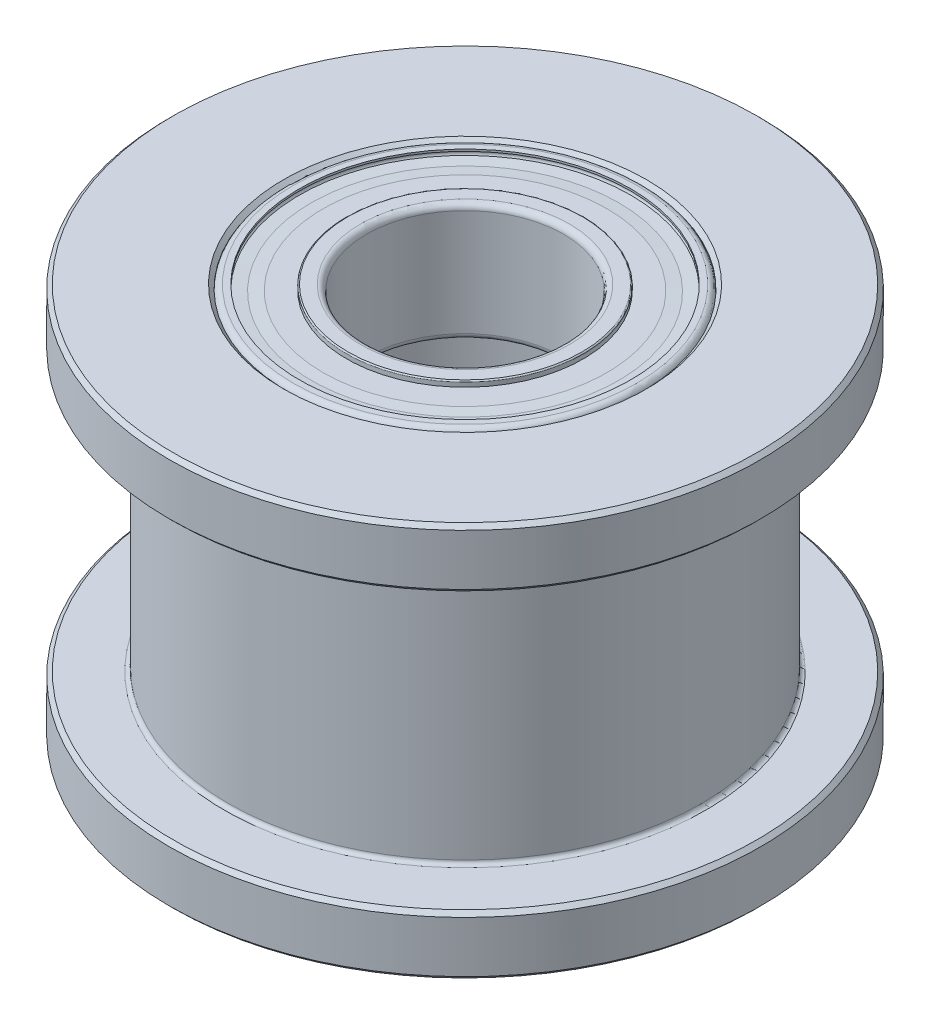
ISO-10303-21;
HEADER;
FILE_DESCRIPTION(('STEP AP214'),'2;1');
FILE_NAME('part.step','',(''),(''),'','','');
FILE_SCHEMA(('AUTOMOTIVE_DESIGN { 1 0 10303 214 1 1 1 1 }'));
ENDSEC;
DATA;
#1=APPLICATION_CONTEXT('core data for automotive mechanical design processes');
#2=APPLICATION_PROTOCOL_DEFINITION('international standard','automotive_design',2000,#1);
#3=PRODUCT_CONTEXT('',#1,'mechanical');
#4=PRODUCT('Part','Part','',(#3));
#5=PRODUCT_RELATED_PRODUCT_CATEGORY('part','',(#4));
#6=PRODUCT_DEFINITION_FORMATION('','',#4);
#7=PRODUCT_DEFINITION_CONTEXT('part definition',#1,'design');
#8=PRODUCT_DEFINITION('design','',#6,#7);
#9=PRODUCT_DEFINITION_SHAPE('','',#8);
#10=(LENGTH_UNIT() NAMED_UNIT(*) SI_UNIT(.MILLI.,.METRE.));
#11=(NAMED_UNIT(*) PLANE_ANGLE_UNIT() SI_UNIT($,.RADIAN.));
#12=(NAMED_UNIT(*) SI_UNIT($,.STERADIAN.) SOLID_ANGLE_UNIT());
#13=UNCERTAINTY_MEASURE_WITH_UNIT(LENGTH_MEASURE(1.E-05),#10,'distance_accuracy_value','');
#14=(GEOMETRIC_REPRESENTATION_CONTEXT(3) GLOBAL_UNCERTAINTY_ASSIGNED_CONTEXT((#13)) GLOBAL_UNIT_ASSIGNED_CONTEXT((#10,
#11,#12)) REPRESENTATION_CONTEXT('',''));
#15=CARTESIAN_POINT('',(0.,0.,0.));
#16=DIRECTION('',(0.,0.,1.));
#17=DIRECTION('',(1.,0.,0.));
#18=AXIS2_PLACEMENT_3D('',#15,#16,#17);
#19=CARTESIAN_POINT('',(2.43951839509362,1.5,-2.43951839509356));
#20=DIRECTION('',(0.,1.,0.));
#21=DIRECTION('',(0.707106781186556,0.,-0.707106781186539));
#22=AXIS2_PLACEMENT_3D('',#19,#20,#21);
#23=SPHERICAL_SURFACE('',#22,0.6);
#24=CARTESIAN_POINT('',(2.43951839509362,2.1,-2.43951839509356));
#25=VERTEX_POINT('',#24);
#26=VERTEX_LOOP('',#25);
#27=FACE_BOUND('',#26,.T.);
#28=ADVANCED_FACE('F43',(#27),#23,.T.);
#29=CLOSED_SHELL('',(#28));
#30=MANIFOLD_SOLID_BREP('B2',#29);
#31=CARTESIAN_POINT('',(0.,1.5,-3.45));
#32=DIRECTION('',(0.,1.,0.));
#33=DIRECTION('',(0.,0.,-1.));
#34=AXIS2_PLACEMENT_3D('',#31,#32,#33);
#35=SPHERICAL_SURFACE('',#34,0.6);
#36=CARTESIAN_POINT('',(0.,2.1,-3.45));
#37=VERTEX_POINT('',#36);
#38=VERTEX_LOOP('',#37);
#39=FACE_BOUND('',#38,.T.);
#40=ADVANCED_FACE('F81',(#39),#35,.T.);
#41=CLOSED_SHELL('',(#40));
#42=MANIFOLD_SOLID_BREP('B6',#41);
#43=CARTESIAN_POINT('',(-2.43951839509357,1.5,-2.43951839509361));
#44=DIRECTION('',(0.,1.,0.));
#45=DIRECTION('',(-0.707106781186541,0.,-0.707106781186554));
#46=AXIS2_PLACEMENT_3D('',#43,#44,#45);
#47=SPHERICAL_SURFACE('',#46,0.6);
#48=CARTESIAN_POINT('',(-2.43951839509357,2.1,-2.43951839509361));
#49=VERTEX_POINT('',#48);
#50=VERTEX_LOOP('',#49);
#51=FACE_BOUND('',#50,.T.);
#52=ADVANCED_FACE('F119',(#51),#47,.T.);
#53=CLOSED_SHELL('',(#52));
#54=MANIFOLD_SOLID_BREP('B39',#53);
#55=CARTESIAN_POINT('',(-3.45,1.5,0.));
#56=DIRECTION('',(0.,1.,0.));
#57=DIRECTION('',(-1.,0.,0.));
#58=AXIS2_PLACEMENT_3D('',#55,#56,#57);
#59=SPHERICAL_SURFACE('',#58,0.6);
#60=CARTESIAN_POINT('',(-3.45,2.1,0.));
#61=VERTEX_POINT('',#60);
#62=VERTEX_LOOP('',#61);
#63=FACE_BOUND('',#62,.T.);
#64=ADVANCED_FACE('F157',(#63),#59,.T.);
#65=CLOSED_SHELL('',(#64));
#66=MANIFOLD_SOLID_BREP('B77',#65);
#67=CARTESIAN_POINT('',(-2.4395183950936,1.5,2.43951839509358));
#68=DIRECTION('',(0.,1.,0.));
#69=DIRECTION('',(-0.707106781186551,0.,0.707106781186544));
#70=AXIS2_PLACEMENT_3D('',#67,#68,#69);
#71=SPHERICAL_SURFACE('',#70,0.6);
#72=CARTESIAN_POINT('',(-2.4395183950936,2.1,2.43951839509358));
#73=VERTEX_POINT('',#72);
#74=VERTEX_LOOP('',#73);
#75=FACE_BOUND('',#74,.T.);
#76=ADVANCED_FACE('F195',(#75),#71,.T.);
#77=CLOSED_SHELL('',(#76));
#78=MANIFOLD_SOLID_BREP('B115',#77);
#79=CARTESIAN_POINT('',(0.,1.5,3.45));
#80=DIRECTION('',(0.,1.,0.));
#81=DIRECTION('',(0.,0.,1.));
#82=AXIS2_PLACEMENT_3D('',#79,#80,#81);
#83=SPHERICAL_SURFACE('',#82,0.6);
#84=CARTESIAN_POINT('',(0.,2.1,3.45));
#85=VERTEX_POINT('',#84);
#86=VERTEX_LOOP('',#85);
#87=FACE_BOUND('',#86,.T.);
#88=ADVANCED_FACE('F233',(#87),#83,.T.);
#89=CLOSED_SHELL('',(#88));
#90=MANIFOLD_SOLID_BREP('B153',#89);
#91=CARTESIAN_POINT('',(2.43951839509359,1.5,2.43951839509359));
#92=DIRECTION('',(0.,1.,0.));
#93=DIRECTION('',(0.707106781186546,0.,0.707106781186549));
#94=AXIS2_PLACEMENT_3D('',#91,#92,#93);
#95=SPHERICAL_SURFACE('',#94,0.6);
#96=CARTESIAN_POINT('',(2.43951839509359,2.1,2.43951839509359));
#97=VERTEX_POINT('',#96);
#98=VERTEX_LOOP('',#97);
#99=FACE_BOUND('',#98,.T.);
#100=ADVANCED_FACE('F271',(#99),#95,.T.);
#101=CLOSED_SHELL('',(#100));
#102=MANIFOLD_SOLID_BREP('B191',#101);
#103=CARTESIAN_POINT('',(3.45,1.5,0.));
#104=DIRECTION('',(0.,1.,0.));
#105=DIRECTION('',(1.,0.,0.));
#106=AXIS2_PLACEMENT_3D('',#103,#104,#105);
#107=SPHERICAL_SURFACE('',#106,0.6);
#108=CARTESIAN_POINT('',(3.45,2.1,0.));
#109=VERTEX_POINT('',#108);
#110=VERTEX_LOOP('',#109);
#111=FACE_BOUND('',#110,.T.);
#112=ADVANCED_FACE('F311',(#111),#107,.T.);
#113=CLOSED_SHELL('',(#112));
#114=MANIFOLD_SOLID_BREP('B229',#113);
#115=CARTESIAN_POINT('',(3.9,2.77,0.));
#116=DIRECTION('',(0.,1.,0.));
#117=DIRECTION('',(-1.,0.,0.));
#118=AXIS2_PLACEMENT_3D('',#115,#116,#117);
#119=PLANE('',#118);
#120=CARTESIAN_POINT('',(0.,2.77,0.));
#121=DIRECTION('',(0.,1.,0.));
#122=DIRECTION('',(-1.,0.,0.));
#123=AXIS2_PLACEMENT_3D('',#120,#121,#122);
#124=CIRCLE('',#123,3.9);
#125=CARTESIAN_POINT('',(-3.9,2.77,0.));
#126=VERTEX_POINT('',#125);
#127=EDGE_CURVE('E310',#126,#126,#124,.T.);
#128=ORIENTED_EDGE('',*,*,#127,.F.);
#129=EDGE_LOOP('',(#128));
#130=FACE_BOUND('',#129,.T.);
#131=CARTESIAN_POINT('',(0.,2.77,0.));
#132=DIRECTION('',(0.,1.,0.));
#133=DIRECTION('',(-1.,0.,0.));
#134=AXIS2_PLACEMENT_3D('',#131,#132,#133);
#135=CIRCLE('',#134,3.6);
#136=CARTESIAN_POINT('',(-3.6,2.77,0.));
#137=VERTEX_POINT('',#136);
#138=EDGE_CURVE('E413',#137,#137,#135,.T.);
#139=ORIENTED_EDGE('',*,*,#138,.T.);
#140=EDGE_LOOP('',(#139));
#141=FACE_BOUND('',#140,.T.);
#142=ADVANCED_FACE('F331',(#130,#141),#119,.F.);
#143=CARTESIAN_POINT('',(0.,2.77,0.));
#144=DIRECTION('',(0.,1.,0.));
#145=DIRECTION('',(-1.,0.,0.));
#146=AXIS2_PLACEMENT_3D('',#143,#144,#145);
#147=CONICAL_SURFACE('',#146,3.9,1.43824479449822);
#148=CARTESIAN_POINT('',(0.,2.81,0.));
#149=DIRECTION('',(0.,1.,0.));
#150=DIRECTION('',(-1.,0.,0.));
#151=AXIS2_PLACEMENT_3D('',#148,#149,#150);
#152=CIRCLE('',#151,4.2);
#153=CARTESIAN_POINT('',(-4.2,2.81,0.));
#154=VERTEX_POINT('',#153);
#155=EDGE_CURVE('E337',#154,#154,#152,.T.);
#156=ORIENTED_EDGE('',*,*,#155,.F.);
#157=EDGE_LOOP('',(#156));
#158=FACE_BOUND('',#157,.T.);
#159=ORIENTED_EDGE('',*,*,#127,.T.);
#160=EDGE_LOOP('',(#159));
#161=FACE_BOUND('',#160,.T.);
#162=ADVANCED_FACE('F558',(#158,#161),#147,.T.);
#163=CARTESIAN_POINT('',(0.,0.,0.));
#164=DIRECTION('',(0.,1.,0.));
#165=DIRECTION('',(-1.,0.,0.));
#166=AXIS2_PLACEMENT_3D('',#163,#164,#165);
#167=CYLINDRICAL_SURFACE('',#166,4.2);
#168=CARTESIAN_POINT('',(0.,2.86,0.));
#169=DIRECTION('',(0.,1.,0.));
#170=DIRECTION('',(-1.,0.,0.));
#171=AXIS2_PLACEMENT_3D('',#168,#169,#170);
#172=CIRCLE('',#171,4.2);
#173=CARTESIAN_POINT('',(-4.2,2.86,0.));
#174=VERTEX_POINT('',#173);
#175=EDGE_CURVE('E341',#174,#174,#172,.T.);
#176=ORIENTED_EDGE('',*,*,#175,.F.);
#177=EDGE_LOOP('',(#176));
#178=FACE_BOUND('',#177,.T.);
#179=ORIENTED_EDGE('',*,*,#155,.T.);
#180=EDGE_LOOP('',(#179));
#181=FACE_BOUND('',#180,.T.);
#182=ADVANCED_FACE('F553',(#178,#181),#167,.T.);
#183=CARTESIAN_POINT('',(0.,2.86,0.));
#184=DIRECTION('',(0.,1.,0.));
#185=DIRECTION('',(-1.,0.,0.));
#186=AXIS2_PLACEMENT_3D('',#183,#184,#185);
#187=CONICAL_SURFACE('',#186,4.2,1.50422816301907);
#188=CARTESIAN_POINT('',(0.,2.84,0.));
#189=DIRECTION('',(0.,1.,0.));
#190=DIRECTION('',(-1.,0.,0.));
#191=AXIS2_PLACEMENT_3D('',#188,#189,#190);
#192=CIRCLE('',#191,3.9);
#193=CARTESIAN_POINT('',(-3.9,2.84,0.));
#194=VERTEX_POINT('',#193);
#195=EDGE_CURVE('E345',#194,#194,#192,.T.);
#196=ORIENTED_EDGE('',*,*,#195,.F.);
#197=EDGE_LOOP('',(#196));
#198=FACE_BOUND('',#197,.T.);
#199=ORIENTED_EDGE('',*,*,#175,.T.);
#200=EDGE_LOOP('',(#199));
#201=FACE_BOUND('',#200,.T.);
#202=ADVANCED_FACE('F547',(#198,#201),#187,.F.);
#203=CARTESIAN_POINT('',(0.,2.84,0.));
#204=DIRECTION('',(0.,-1.,0.));
#205=DIRECTION('',(1.,0.,0.));
#206=AXIS2_PLACEMENT_3D('',#203,#204,#205);
#207=CONICAL_SURFACE('',#206,3.9,1.50422816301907);
#208=CARTESIAN_POINT('',(0.,2.86,0.));
#209=DIRECTION('',(0.,1.,0.));
#210=DIRECTION('',(-1.,0.,0.));
#211=AXIS2_PLACEMENT_3D('',#208,#209,#210);
#212=CIRCLE('',#211,3.6);
#213=CARTESIAN_POINT('',(-3.6,2.86,0.));
#214=VERTEX_POINT('',#213);
#215=EDGE_CURVE('E350',#214,#214,#212,.T.);
#216=ORIENTED_EDGE('',*,*,#215,.F.);
#217=EDGE_LOOP('',(#216));
#218=FACE_BOUND('',#217,.T.);
#219=ORIENTED_EDGE('',*,*,#195,.T.);
#220=EDGE_LOOP('',(#219));
#221=FACE_BOUND('',#220,.T.);
#222=ADVANCED_FACE('F541',(#218,#221),#207,.T.);
#223=CARTESIAN_POINT('',(3.,2.86,0.));
#224=DIRECTION('',(0.,-1.,0.));
#225=DIRECTION('',(1.,0.,0.));
#226=AXIS2_PLACEMENT_3D('',#223,#224,#225);
#227=PLANE('',#226);
#228=CARTESIAN_POINT('',(0.,2.86,0.));
#229=DIRECTION('',(0.,1.,0.));
#230=DIRECTION('',(-1.,0.,0.));
#231=AXIS2_PLACEMENT_3D('',#228,#229,#230);
#232=CIRCLE('',#231,3.);
#233=CARTESIAN_POINT('',(-3.,2.86,0.));
#234=VERTEX_POINT('',#233);
#235=EDGE_CURVE('E353',#234,#234,#232,.T.);
#236=ORIENTED_EDGE('',*,*,#235,.F.);
#237=EDGE_LOOP('',(#236));
#238=FACE_BOUND('',#237,.T.);
#239=ORIENTED_EDGE('',*,*,#215,.T.);
#240=EDGE_LOOP('',(#239));
#241=FACE_BOUND('',#240,.T.);
#242=ADVANCED_FACE('F535',(#238,#241),#227,.F.);
#243=CARTESIAN_POINT('',(0.,0.,0.));
#244=DIRECTION('',(0.,1.,0.));
#245=DIRECTION('',(-1.,0.,0.));
#246=AXIS2_PLACEMENT_3D('',#243,#244,#245);
#247=CYLINDRICAL_SURFACE('',#246,3.);
#248=CARTESIAN_POINT('',(0.,2.97,0.));
#249=DIRECTION('',(0.,1.,0.));
#250=DIRECTION('',(-1.,0.,0.));
#251=AXIS2_PLACEMENT_3D('',#248,#249,#250);
#252=CIRCLE('',#251,3.);
#253=CARTESIAN_POINT('',(-3.,2.97,0.));
#254=VERTEX_POINT('',#253);
#255=EDGE_CURVE('E356',#254,#254,#252,.T.);
#256=ORIENTED_EDGE('',*,*,#255,.F.);
#257=EDGE_LOOP('',(#256));
#258=FACE_BOUND('',#257,.T.);
#259=ORIENTED_EDGE('',*,*,#235,.T.);
#260=EDGE_LOOP('',(#259));
#261=FACE_BOUND('',#260,.T.);
#262=ADVANCED_FACE('F529',(#258,#261),#247,.T.);
#263=CARTESIAN_POINT('',(0.,2.97,0.));
#264=DIRECTION('',(0.,1.,0.));
#265=DIRECTION('',(-1.,0.,0.));
#266=AXIS2_PLACEMENT_3D('',#263,#264,#265);
#267=TOROIDAL_SURFACE('',#266,2.97,0.0300000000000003);
#268=CARTESIAN_POINT('',(0.,3.,0.));
#269=DIRECTION('',(0.,1.,0.));
#270=DIRECTION('',(-1.,0.,0.));
#271=AXIS2_PLACEMENT_3D('',#268,#269,#270);
#272=CIRCLE('',#271,2.97);
#273=CARTESIAN_POINT('',(-2.97,3.,0.));
#274=VERTEX_POINT('',#273);
#275=EDGE_CURVE('E359',#274,#274,#272,.T.);
#276=ORIENTED_EDGE('',*,*,#275,.F.);
#277=EDGE_LOOP('',(#276));
#278=FACE_BOUND('',#277,.T.);
#279=ORIENTED_EDGE('',*,*,#255,.T.);
#280=EDGE_LOOP('',(#279));
#281=FACE_BOUND('',#280,.T.);
#282=ADVANCED_FACE('F523',(#278,#281),#267,.T.);
#283=CARTESIAN_POINT('',(2.65,3.,0.));
#284=DIRECTION('',(0.,-1.,0.));
#285=DIRECTION('',(1.,0.,0.));
#286=AXIS2_PLACEMENT_3D('',#283,#284,#285);
#287=PLANE('',#286);
#288=CARTESIAN_POINT('',(0.,3.,0.));
#289=DIRECTION('',(0.,1.,0.));
#290=DIRECTION('',(-1.,0.,0.));
#291=AXIS2_PLACEMENT_3D('',#288,#289,#290);
#292=CIRCLE('',#291,2.65);
#293=CARTESIAN_POINT('',(-2.65,3.,0.));
#294=VERTEX_POINT('',#293);
#295=EDGE_CURVE('E362',#294,#294,#292,.T.);
#296=ORIENTED_EDGE('',*,*,#295,.F.);
#297=EDGE_LOOP('',(#296));
#298=FACE_BOUND('',#297,.T.);
#299=ORIENTED_EDGE('',*,*,#275,.T.);
#300=EDGE_LOOP('',(#299));
#301=FACE_BOUND('',#300,.T.);
#302=ADVANCED_FACE('F517',(#298,#301),#287,.F.);
#303=CARTESIAN_POINT('',(0.,2.85,0.));
#304=DIRECTION('',(0.,1.,0.));
#305=DIRECTION('',(-1.,0.,0.));
#306=AXIS2_PLACEMENT_3D('',#303,#304,#305);
#307=TOROIDAL_SURFACE('',#306,2.65,0.15);
#308=CARTESIAN_POINT('',(0.,2.85,0.));
#309=DIRECTION('',(0.,1.,0.));
#310=DIRECTION('',(-1.,0.,0.));
#311=AXIS2_PLACEMENT_3D('',#308,#309,#310);
#312=CIRCLE('',#311,2.5);
#313=CARTESIAN_POINT('',(-2.5,2.85,0.));
#314=VERTEX_POINT('',#313);
#315=EDGE_CURVE('E365',#314,#314,#312,.T.);
#316=ORIENTED_EDGE('',*,*,#315,.F.);
#317=EDGE_LOOP('',(#316));
#318=FACE_BOUND('',#317,.T.);
#319=ORIENTED_EDGE('',*,*,#295,.T.);
#320=EDGE_LOOP('',(#319));
#321=FACE_BOUND('',#320,.T.);
#322=ADVANCED_FACE('F511',(#318,#321),#307,.T.);
#323=CARTESIAN_POINT('',(0.,0.,0.));
#324=DIRECTION('',(0.,1.,0.));
#325=DIRECTION('',(-1.,0.,0.));
#326=AXIS2_PLACEMENT_3D('',#323,#324,#325);
#327=CYLINDRICAL_SURFACE('',#326,2.5);
#328=CARTESIAN_POINT('',(0.,0.15,0.));
#329=DIRECTION('',(0.,1.,0.));
#330=DIRECTION('',(-1.,0.,0.));
#331=AXIS2_PLACEMENT_3D('',#328,#329,#330);
#332=CIRCLE('',#331,2.5);
#333=CARTESIAN_POINT('',(-2.5,0.149999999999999,0.));
#334=VERTEX_POINT('',#333);
#335=EDGE_CURVE('E368',#334,#334,#332,.T.);
#336=ORIENTED_EDGE('',*,*,#335,.F.);
#337=EDGE_LOOP('',(#336));
#338=FACE_BOUND('',#337,.T.);
#339=ORIENTED_EDGE('',*,*,#315,.T.);
#340=EDGE_LOOP('',(#339));
#341=FACE_BOUND('',#340,.T.);
#342=ADVANCED_FACE('F505',(#338,#341),#327,.F.);
#343=CARTESIAN_POINT('',(0.,0.15,0.));
#344=DIRECTION('',(0.,1.,0.));
#345=DIRECTION('',(-1.,0.,0.));
#346=AXIS2_PLACEMENT_3D('',#343,#344,#345);
#347=TOROIDAL_SURFACE('',#346,2.65,0.15);
#348=CARTESIAN_POINT('',(0.,0.,0.));
#349=DIRECTION('',(0.,1.,0.));
#350=DIRECTION('',(-1.,0.,0.));
#351=AXIS2_PLACEMENT_3D('',#348,#349,#350);
#352=CIRCLE('',#351,2.65);
#353=CARTESIAN_POINT('',(-2.65,0.,0.));
#354=VERTEX_POINT('',#353);
#355=EDGE_CURVE('E371',#354,#354,#352,.T.);
#356=ORIENTED_EDGE('',*,*,#355,.F.);
#357=EDGE_LOOP('',(#356));
#358=FACE_BOUND('',#357,.T.);
#359=ORIENTED_EDGE('',*,*,#335,.T.);
#360=EDGE_LOOP('',(#359));
#361=FACE_BOUND('',#360,.T.);
#362=ADVANCED_FACE('F499',(#358,#361),#347,.T.);
#363=CARTESIAN_POINT('',(2.65,0.,0.));
#364=DIRECTION('',(0.,1.,0.));
#365=DIRECTION('',(-1.,0.,0.));
#366=AXIS2_PLACEMENT_3D('',#363,#364,#365);
#367=PLANE('',#366);
#368=CARTESIAN_POINT('',(0.,0.,0.));
#369=DIRECTION('',(0.,1.,0.));
#370=DIRECTION('',(-1.,0.,0.));
#371=AXIS2_PLACEMENT_3D('',#368,#369,#370);
#372=CIRCLE('',#371,2.97);
#373=CARTESIAN_POINT('',(-2.97,0.,0.));
#374=VERTEX_POINT('',#373);
#375=EDGE_CURVE('E374',#374,#374,#372,.T.);
#376=ORIENTED_EDGE('',*,*,#375,.F.);
#377=EDGE_LOOP('',(#376));
#378=FACE_BOUND('',#377,.T.);
#379=ORIENTED_EDGE('',*,*,#355,.T.);
#380=EDGE_LOOP('',(#379));
#381=FACE_BOUND('',#380,.T.);
#382=ADVANCED_FACE('F493',(#378,#381),#367,.F.);
#383=CARTESIAN_POINT('',(0.,0.0300000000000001,0.));
#384=DIRECTION('',(0.,1.,0.));
#385=DIRECTION('',(-1.,0.,0.));
#386=AXIS2_PLACEMENT_3D('',#383,#384,#385);
#387=TOROIDAL_SURFACE('',#386,2.97,0.0300000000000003);
#388=CARTESIAN_POINT('',(0.,0.0300000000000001,0.));
#389=DIRECTION('',(0.,1.,0.));
#390=DIRECTION('',(-1.,0.,0.));
#391=AXIS2_PLACEMENT_3D('',#388,#389,#390);
#392=CIRCLE('',#391,3.);
#393=CARTESIAN_POINT('',(-3.,0.0299999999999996,0.));
#394=VERTEX_POINT('',#393);
#395=EDGE_CURVE('E377',#394,#394,#392,.T.);
#396=ORIENTED_EDGE('',*,*,#395,.F.);
#397=EDGE_LOOP('',(#396));
#398=FACE_BOUND('',#397,.T.);
#399=ORIENTED_EDGE('',*,*,#375,.T.);
#400=EDGE_LOOP('',(#399));
#401=FACE_BOUND('',#400,.T.);
#402=ADVANCED_FACE('F487',(#398,#401),#387,.T.);
#403=CARTESIAN_POINT('',(0.,0.,0.));
#404=DIRECTION('',(0.,1.,0.));
#405=DIRECTION('',(-1.,0.,0.));
#406=AXIS2_PLACEMENT_3D('',#403,#404,#405);
#407=CYLINDRICAL_SURFACE('',#406,3.);
#408=CARTESIAN_POINT('',(0.,0.14,0.));
#409=DIRECTION('',(0.,1.,0.));
#410=DIRECTION('',(-1.,0.,0.));
#411=AXIS2_PLACEMENT_3D('',#408,#409,#410);
#412=CIRCLE('',#411,3.);
#413=CARTESIAN_POINT('',(-3.,0.14,0.));
#414=VERTEX_POINT('',#413);
#415=EDGE_CURVE('E380',#414,#414,#412,.T.);
#416=ORIENTED_EDGE('',*,*,#415,.F.);
#417=EDGE_LOOP('',(#416));
#418=FACE_BOUND('',#417,.T.);
#419=ORIENTED_EDGE('',*,*,#395,.T.);
#420=EDGE_LOOP('',(#419));
#421=FACE_BOUND('',#420,.T.);
#422=ADVANCED_FACE('F481',(#418,#421),#407,.T.);
#423=CARTESIAN_POINT('',(3.,0.14,0.));
#424=DIRECTION('',(0.,1.,0.));
#425=DIRECTION('',(-1.,0.,0.));
#426=AXIS2_PLACEMENT_3D('',#423,#424,#425);
#427=PLANE('',#426);
#428=CARTESIAN_POINT('',(0.,0.14,0.));
#429=DIRECTION('',(0.,1.,0.));
#430=DIRECTION('',(-1.,0.,0.));
#431=AXIS2_PLACEMENT_3D('',#428,#429,#430);
#432=CIRCLE('',#431,3.6);
#433=CARTESIAN_POINT('',(-3.6,0.139999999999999,0.));
#434=VERTEX_POINT('',#433);
#435=EDGE_CURVE('E383',#434,#434,#432,.T.);
#436=ORIENTED_EDGE('',*,*,#435,.F.);
#437=EDGE_LOOP('',(#436));
#438=FACE_BOUND('',#437,.T.);
#439=ORIENTED_EDGE('',*,*,#415,.T.);
#440=EDGE_LOOP('',(#439));
#441=FACE_BOUND('',#440,.T.);
#442=ADVANCED_FACE('F475',(#438,#441),#427,.F.);
#443=CARTESIAN_POINT('',(0.,0.14,0.));
#444=DIRECTION('',(0.,1.,0.));
#445=DIRECTION('',(-1.,0.,0.));
#446=AXIS2_PLACEMENT_3D('',#443,#444,#445);
#447=CONICAL_SURFACE('',#446,3.6,1.39793572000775);
#448=CARTESIAN_POINT('',(0.,0.191714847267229,0.));
#449=DIRECTION('',(0.,1.,0.));
#450=DIRECTION('',(-1.,0.,0.));
#451=AXIS2_PLACEMENT_3D('',#448,#449,#450);
#452=CIRCLE('',#451,3.89618503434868);
#453=CARTESIAN_POINT('',(-3.89618503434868,0.191714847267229,0.));
#454=VERTEX_POINT('',#453);
#455=EDGE_CURVE('E386',#454,#454,#452,.T.);
#456=ORIENTED_EDGE('',*,*,#455,.F.);
#457=EDGE_LOOP('',(#456));
#458=FACE_BOUND('',#457,.T.);
#459=ORIENTED_EDGE('',*,*,#435,.T.);
#460=EDGE_LOOP('',(#459));
#461=FACE_BOUND('',#460,.T.);
#462=ADVANCED_FACE('F469',(#458,#461),#447,.T.);
#463=CARTESIAN_POINT('',(0.,0.191714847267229,0.));
#464=DIRECTION('',(0.,-1.,0.));
#465=DIRECTION('',(1.,0.,0.));
#466=AXIS2_PLACEMENT_3D('',#463,#464,#465);
#467=CONICAL_SURFACE('',#466,3.89618503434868,1.39793572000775);
#468=CARTESIAN_POINT('',(0.,0.14,0.));
#469=DIRECTION('',(0.,1.,0.));
#470=DIRECTION('',(-1.,0.,0.));
#471=AXIS2_PLACEMENT_3D('',#468,#469,#470);
#472=CIRCLE('',#471,4.19237006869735);
#473=CARTESIAN_POINT('',(-4.19237006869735,0.139999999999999,0.));
#474=VERTEX_POINT('',#473);
#475=EDGE_CURVE('E389',#474,#474,#472,.T.);
#476=ORIENTED_EDGE('',*,*,#475,.F.);
#477=EDGE_LOOP('',(#476));
#478=FACE_BOUND('',#477,.T.);
#479=ORIENTED_EDGE('',*,*,#455,.T.);
#480=EDGE_LOOP('',(#479));
#481=FACE_BOUND('',#480,.T.);
#482=ADVANCED_FACE('F463',(#478,#481),#467,.F.);
#483=CARTESIAN_POINT('',(0.,0.,0.));
#484=DIRECTION('',(0.,1.,0.));
#485=DIRECTION('',(-1.,0.,0.));
#486=AXIS2_PLACEMENT_3D('',#483,#484,#485);
#487=CYLINDRICAL_SURFACE('',#486,4.19237006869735);
#488=CARTESIAN_POINT('',(0.,0.190000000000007,0.));
#489=DIRECTION('',(0.,1.,0.));
#490=DIRECTION('',(-1.,0.,0.));
#491=AXIS2_PLACEMENT_3D('',#488,#489,#490);
#492=CIRCLE('',#491,4.19237006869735);
#493=CARTESIAN_POINT('',(-4.19237006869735,0.190000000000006,0.));
#494=VERTEX_POINT('',#493);
#495=EDGE_CURVE('E392',#494,#494,#492,.T.);
#496=ORIENTED_EDGE('',*,*,#495,.F.);
#497=EDGE_LOOP('',(#496));
#498=FACE_BOUND('',#497,.T.);
#499=ORIENTED_EDGE('',*,*,#475,.T.);
#500=EDGE_LOOP('',(#499));
#501=FACE_BOUND('',#500,.T.);
#502=ADVANCED_FACE('F457',(#498,#501),#487,.T.);
#503=CARTESIAN_POINT('',(0.,0.190000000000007,0.));
#504=DIRECTION('',(0.,-1.,0.));
#505=DIRECTION('',(1.,0.,0.));
#506=AXIS2_PLACEMENT_3D('',#503,#504,#505);
#507=CONICAL_SURFACE('',#506,4.19237006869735,1.34397129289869);
#508=CARTESIAN_POINT('',(0.,0.258062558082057,0.));
#509=DIRECTION('',(0.,1.,0.));
#510=DIRECTION('',(-1.,0.,0.));
#511=AXIS2_PLACEMENT_3D('',#508,#509,#510);
#512=CIRCLE('',#511,3.89746756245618);
#513=CARTESIAN_POINT('',(-3.89746756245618,0.258062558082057,0.));
#514=VERTEX_POINT('',#513);
#515=EDGE_CURVE('E395',#514,#514,#512,.T.);
#516=ORIENTED_EDGE('',*,*,#515,.F.);
#517=EDGE_LOOP('',(#516));
#518=FACE_BOUND('',#517,.T.);
#519=ORIENTED_EDGE('',*,*,#495,.T.);
#520=EDGE_LOOP('',(#519));
#521=FACE_BOUND('',#520,.T.);
#522=ADVANCED_FACE('F451',(#518,#521),#507,.T.);
#523=CARTESIAN_POINT('',(3.89746756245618,0.258062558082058,0.));
#524=DIRECTION('',(0.,-1.,0.));
#525=DIRECTION('',(1.,0.,0.));
#526=AXIS2_PLACEMENT_3D('',#523,#524,#525);
#527=PLANE('',#526);
#528=CARTESIAN_POINT('',(0.,0.258062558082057,0.));
#529=DIRECTION('',(0.,1.,0.));
#530=DIRECTION('',(-1.,0.,0.));
#531=AXIS2_PLACEMENT_3D('',#528,#529,#530);
#532=CIRCLE('',#531,3.59746756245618);
#533=CARTESIAN_POINT('',(-3.59746756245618,0.258062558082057,0.));
#534=VERTEX_POINT('',#533);
#535=EDGE_CURVE('E398',#534,#534,#532,.T.);
#536=ORIENTED_EDGE('',*,*,#535,.F.);
#537=EDGE_LOOP('',(#536));
#538=FACE_BOUND('',#537,.T.);
#539=ORIENTED_EDGE('',*,*,#515,.T.);
#540=EDGE_LOOP('',(#539));
#541=FACE_BOUND('',#540,.T.);
#542=ADVANCED_FACE('F445',(#538,#541),#527,.F.);
#543=CARTESIAN_POINT('',(0.,0.258062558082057,0.));
#544=DIRECTION('',(0.,1.,0.));
#545=DIRECTION('',(-1.,0.,0.));
#546=AXIS2_PLACEMENT_3D('',#543,#544,#545);
#547=CONICAL_SURFACE('',#546,3.59746756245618,1.45736689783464);
#548=CARTESIAN_POINT('',(0.,0.19,0.));
#549=DIRECTION('',(0.,1.,0.));
#550=DIRECTION('',(-1.,0.,0.));
#551=AXIS2_PLACEMENT_3D('',#548,#549,#550);
#552=CIRCLE('',#551,3.);
#553=CARTESIAN_POINT('',(-3.,0.189999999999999,0.));
#554=VERTEX_POINT('',#553);
#555=EDGE_CURVE('E401',#554,#554,#552,.T.);
#556=ORIENTED_EDGE('',*,*,#555,.F.);
#557=EDGE_LOOP('',(#556));
#558=FACE_BOUND('',#557,.T.);
#559=ORIENTED_EDGE('',*,*,#535,.T.);
#560=EDGE_LOOP('',(#559));
#561=FACE_BOUND('',#560,.T.);
#562=ADVANCED_FACE('F439',(#558,#561),#547,.F.);
#563=CARTESIAN_POINT('',(0.,0.,0.));
#564=DIRECTION('',(0.,1.,0.));
#565=DIRECTION('',(-1.,0.,0.));
#566=AXIS2_PLACEMENT_3D('',#563,#564,#565);
#567=CYLINDRICAL_SURFACE('',#566,3.);
#568=CARTESIAN_POINT('',(0.,1.10313730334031,0.));
#569=DIRECTION('',(0.,1.,0.));
#570=DIRECTION('',(-1.,0.,0.));
#571=AXIS2_PLACEMENT_3D('',#568,#569,#570);
#572=CIRCLE('',#571,3.);
#573=CARTESIAN_POINT('',(-3.,1.10313730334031,0.));
#574=VERTEX_POINT('',#573);
#575=EDGE_CURVE('E404',#574,#574,#572,.T.);
#576=ORIENTED_EDGE('',*,*,#575,.F.);
#577=EDGE_LOOP('',(#576));
#578=FACE_BOUND('',#577,.T.);
#579=ORIENTED_EDGE('',*,*,#555,.T.);
#580=EDGE_LOOP('',(#579));
#581=FACE_BOUND('',#580,.T.);
#582=ADVANCED_FACE('F433',(#578,#581),#567,.T.);
#583=CARTESIAN_POINT('',(0.,1.5,0.));
#584=DIRECTION('',(0.,1.,0.));
#585=DIRECTION('',(-1.,0.,0.));
#586=AXIS2_PLACEMENT_3D('',#583,#584,#585);
#587=TOROIDAL_SURFACE('',#586,3.45,0.6);
#588=CARTESIAN_POINT('',(0.,1.89686269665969,0.));
#589=DIRECTION('',(0.,1.,0.));
#590=DIRECTION('',(-1.,0.,0.));
#591=AXIS2_PLACEMENT_3D('',#588,#589,#590);
#592=CIRCLE('',#591,3.);
#593=CARTESIAN_POINT('',(-3.,1.89686269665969,0.));
#594=VERTEX_POINT('',#593);
#595=EDGE_CURVE('E407',#594,#594,#592,.T.);
#596=ORIENTED_EDGE('',*,*,#595,.F.);
#597=EDGE_LOOP('',(#596));
#598=FACE_BOUND('',#597,.T.);
#599=ORIENTED_EDGE('',*,*,#575,.T.);
#600=EDGE_LOOP('',(#599));
#601=FACE_BOUND('',#600,.T.);
#602=ADVANCED_FACE('F427',(#598,#601),#587,.F.);
#603=CARTESIAN_POINT('',(0.,0.,0.));
#604=DIRECTION('',(0.,1.,0.));
#605=DIRECTION('',(-1.,0.,0.));
#606=AXIS2_PLACEMENT_3D('',#603,#604,#605);
#607=CYLINDRICAL_SURFACE('',#606,3.);
#608=CARTESIAN_POINT('',(0.,2.81,0.));
#609=DIRECTION('',(0.,1.,0.));
#610=DIRECTION('',(-1.,0.,0.));
#611=AXIS2_PLACEMENT_3D('',#608,#609,#610);
#612=CIRCLE('',#611,3.);
#613=CARTESIAN_POINT('',(-3.,2.81,0.));
#614=VERTEX_POINT('',#613);
#615=EDGE_CURVE('E410',#614,#614,#612,.T.);
#616=ORIENTED_EDGE('',*,*,#615,.F.);
#617=EDGE_LOOP('',(#616));
#618=FACE_BOUND('',#617,.T.);
#619=ORIENTED_EDGE('',*,*,#595,.T.);
#620=EDGE_LOOP('',(#619));
#621=FACE_BOUND('',#620,.T.);
#622=ADVANCED_FACE('F421',(#618,#621),#607,.T.);
#623=CARTESIAN_POINT('',(0.,2.81,0.));
#624=DIRECTION('',(0.,-1.,0.));
#625=DIRECTION('',(1.,0.,0.));
#626=AXIS2_PLACEMENT_3D('',#623,#624,#625);
#627=CONICAL_SURFACE('',#626,3.,1.50422816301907);
#628=ORIENTED_EDGE('',*,*,#138,.F.);
#629=EDGE_LOOP('',(#628));
#630=FACE_BOUND('',#629,.T.);
#631=ORIENTED_EDGE('',*,*,#615,.T.);
#632=EDGE_LOOP('',(#631));
#633=FACE_BOUND('',#632,.T.);
#634=ADVANCED_FACE('F418',(#630,#633),#627,.F.);
#635=CLOSED_SHELL('',(#142,#162,#182,#202,#222,#242,#262,#282,#302,#322,#342,#362,#382,#402,
#422,#442,#462,#482,#502,#522,#542,#562,#582,#602,#622,#634));
#636=MANIFOLD_SOLID_BREP('B267',#635);
#637=CARTESIAN_POINT('',(0.,0.,0.));
#638=DIRECTION('',(0.,-1.,0.));
#639=DIRECTION('',(0.,0.,-1.));
#640=AXIS2_PLACEMENT_3D('',#637,#638,#639);
#641=CYLINDRICAL_SURFACE('',#640,3.85);
#642=CARTESIAN_POINT('',(0.,0.282786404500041,0.));
#643=DIRECTION('',(0.,-1.,0.));
#644=DIRECTION('',(0.,0.,-1.));
#645=AXIS2_PLACEMENT_3D('',#642,#643,#644);
#646=CIRCLE('',#645,3.85);
#647=CARTESIAN_POINT('',(0.,0.282786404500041,-3.85));
#648=VERTEX_POINT('',#647);
#649=EDGE_CURVE('E774',#648,#648,#646,.T.);
#650=ORIENTED_EDGE('',*,*,#649,.T.);
#651=EDGE_LOOP('',(#650));
#652=FACE_BOUND('',#651,.T.);
#653=CARTESIAN_POINT('',(0.,1.05278640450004,0.));
#654=DIRECTION('',(0.,-1.,0.));
#655=DIRECTION('',(0.,0.,-1.));
#656=AXIS2_PLACEMENT_3D('',#653,#654,#655);
#657=CIRCLE('',#656,3.85);
#658=CARTESIAN_POINT('',(0.,1.05278640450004,-3.85));
#659=VERTEX_POINT('',#658);
#660=EDGE_CURVE('E330',#659,#659,#657,.T.);
#661=ORIENTED_EDGE('',*,*,#660,.F.);
#662=EDGE_LOOP('',(#661));
#663=FACE_BOUND('',#662,.T.);
#664=ADVANCED_FACE('F728',(#652,#663),#641,.F.);
#665=CARTESIAN_POINT('',(0.,1.5,0.));
#666=DIRECTION('',(0.,-1.,0.));
#667=DIRECTION('',(0.,0.,-1.));
#668=AXIS2_PLACEMENT_3D('',#665,#666,#667);
#669=TOROIDAL_SURFACE('',#668,3.45,0.600000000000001);
#670=ORIENTED_EDGE('',*,*,#660,.T.);
#671=EDGE_LOOP('',(#670));
#672=FACE_BOUND('',#671,.T.);
#673=CARTESIAN_POINT('',(0.,1.94721359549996,0.));
#674=DIRECTION('',(0.,-1.,0.));
#675=DIRECTION('',(0.,0.,-1.));
#676=AXIS2_PLACEMENT_3D('',#673,#674,#675);
#677=CIRCLE('',#676,3.85);
#678=CARTESIAN_POINT('',(0.,1.94721359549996,-3.85));
#679=VERTEX_POINT('',#678);
#680=EDGE_CURVE('E734',#679,#679,#677,.T.);
#681=ORIENTED_EDGE('',*,*,#680,.F.);
#682=EDGE_LOOP('',(#681));
#683=FACE_BOUND('',#682,.T.);
#684=ADVANCED_FACE('F792',(#672,#683),#669,.F.);
#685=CARTESIAN_POINT('',(0.,0.,0.));
#686=DIRECTION('',(0.,-1.,0.));
#687=DIRECTION('',(0.,0.,-1.));
#688=AXIS2_PLACEMENT_3D('',#685,#686,#687);
#689=CYLINDRICAL_SURFACE('',#688,3.85);
#690=ORIENTED_EDGE('',*,*,#680,.T.);
#691=EDGE_LOOP('',(#690));
#692=FACE_BOUND('',#691,.T.);
#693=CARTESIAN_POINT('',(0.,2.71721359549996,0.));
#694=DIRECTION('',(0.,-1.,0.));
#695=DIRECTION('',(0.,0.,-1.));
#696=AXIS2_PLACEMENT_3D('',#693,#694,#695);
#697=CIRCLE('',#696,3.85);
#698=CARTESIAN_POINT('',(0.,2.71721359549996,-3.85));
#699=VERTEX_POINT('',#698);
#700=EDGE_CURVE('E738',#699,#699,#697,.T.);
#701=ORIENTED_EDGE('',*,*,#700,.F.);
#702=EDGE_LOOP('',(#701));
#703=FACE_BOUND('',#702,.T.);
#704=ADVANCED_FACE('F796',(#692,#703),#689,.F.);
#705=CARTESIAN_POINT('',(0.,2.77096999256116,0.));
#706=DIRECTION('',(0.,1.,0.));
#707=DIRECTION('',(0.,0.,1.));
#708=AXIS2_PLACEMENT_3D('',#705,#706,#707);
#709=CONICAL_SURFACE('',#708,4.21317792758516,1.42384660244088);
#710=ORIENTED_EDGE('',*,*,#700,.T.);
#711=EDGE_LOOP('',(#710));
#712=FACE_BOUND('',#711,.T.);
#713=CARTESIAN_POINT('',(0.,2.77096999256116,0.));
#714=DIRECTION('',(0.,-1.,0.));
#715=DIRECTION('',(0.,0.,-1.));
#716=AXIS2_PLACEMENT_3D('',#713,#714,#715);
#717=CIRCLE('',#716,4.21317792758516);
#718=CARTESIAN_POINT('',(0.,2.77096999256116,-4.21317792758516));
#719=VERTEX_POINT('',#718);
#720=EDGE_CURVE('E742',#719,#719,#717,.T.);
#721=ORIENTED_EDGE('',*,*,#720,.F.);
#722=EDGE_LOOP('',(#721));
#723=FACE_BOUND('',#722,.T.);
#724=ADVANCED_FACE('F800',(#712,#723),#709,.F.);
#725=CARTESIAN_POINT('',(0.,2.86,0.));
#726=DIRECTION('',(0.,-1.,0.));
#727=DIRECTION('',(0.,0.,-1.));
#728=AXIS2_PLACEMENT_3D('',#725,#726,#727);
#729=TOROIDAL_SURFACE('',#728,4.2,0.09);
#730=ORIENTED_EDGE('',*,*,#720,.T.);
#731=EDGE_LOOP('',(#730));
#732=FACE_BOUND('',#731,.T.);
#733=CARTESIAN_POINT('',(0.,2.95,0.));
#734=DIRECTION('',(0.,-1.,0.));
#735=DIRECTION('',(0.,0.,-1.));
#736=AXIS2_PLACEMENT_3D('',#733,#734,#735);
#737=CIRCLE('',#736,4.2);
#738=CARTESIAN_POINT('',(0.,2.95,-4.2));
#739=VERTEX_POINT('',#738);
#740=EDGE_CURVE('E747',#739,#739,#737,.T.);
#741=ORIENTED_EDGE('',*,*,#740,.F.);
#742=EDGE_LOOP('',(#741));
#743=FACE_BOUND('',#742,.T.);
#744=ADVANCED_FACE('F806',(#732,#743),#729,.F.);
#745=CARTESIAN_POINT('',(0.,0.,0.));
#746=DIRECTION('',(0.,-1.,0.));
#747=DIRECTION('',(0.,0.,-1.));
#748=AXIS2_PLACEMENT_3D('',#745,#746,#747);
#749=CYLINDRICAL_SURFACE('',#748,4.2);
#750=ORIENTED_EDGE('',*,*,#740,.T.);
#751=EDGE_LOOP('',(#750));
#752=FACE_BOUND('',#751,.T.);
#753=CARTESIAN_POINT('',(0.,3.,0.));
#754=DIRECTION('',(0.,-1.,0.));
#755=DIRECTION('',(0.,0.,-1.));
#756=AXIS2_PLACEMENT_3D('',#753,#754,#755);
#757=CIRCLE('',#756,4.2);
#758=CARTESIAN_POINT('',(0.,3.,-4.2));
#759=VERTEX_POINT('',#758);
#760=EDGE_CURVE('E750',#759,#759,#757,.T.);
#761=ORIENTED_EDGE('',*,*,#760,.F.);
#762=EDGE_LOOP('',(#761));
#763=FACE_BOUND('',#762,.T.);
#764=ADVANCED_FACE('F810',(#752,#763),#749,.F.);
#765=CARTESIAN_POINT('',(4.35,3.,0.));
#766=DIRECTION('',(0.,1.,0.));
#767=DIRECTION('',(0.,0.,1.));
#768=AXIS2_PLACEMENT_3D('',#765,#766,#767);
#769=PLANE('',#768);
#770=ORIENTED_EDGE('',*,*,#760,.T.);
#771=EDGE_LOOP('',(#770));
#772=FACE_BOUND('',#771,.T.);
#773=CARTESIAN_POINT('',(0.,3.,0.));
#774=DIRECTION('',(0.,-1.,0.));
#775=DIRECTION('',(0.,0.,-1.));
#776=AXIS2_PLACEMENT_3D('',#773,#774,#775);
#777=CIRCLE('',#776,4.35);
#778=CARTESIAN_POINT('',(0.,3.,-4.35));
#779=VERTEX_POINT('',#778);
#780=EDGE_CURVE('E753',#779,#779,#777,.T.);
#781=ORIENTED_EDGE('',*,*,#780,.F.);
#782=EDGE_LOOP('',(#781));
#783=FACE_BOUND('',#782,.T.);
#784=ADVANCED_FACE('F814',(#772,#783),#769,.T.);
#785=CARTESIAN_POINT('',(0.,2.85,0.));
#786=DIRECTION('',(0.,-1.,0.));
#787=DIRECTION('',(0.,0.,-1.));
#788=AXIS2_PLACEMENT_3D('',#785,#786,#787);
#789=TOROIDAL_SURFACE('',#788,4.35,0.150000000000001);
#790=ORIENTED_EDGE('',*,*,#780,.T.);
#791=EDGE_LOOP('',(#790));
#792=FACE_BOUND('',#791,.T.);
#793=CARTESIAN_POINT('',(0.,2.85,0.));
#794=DIRECTION('',(0.,-1.,0.));
#795=DIRECTION('',(0.,0.,-1.));
#796=AXIS2_PLACEMENT_3D('',#793,#794,#795);
#797=CIRCLE('',#796,4.5);
#798=CARTESIAN_POINT('',(0.,2.85,-4.5));
#799=VERTEX_POINT('',#798);
#800=EDGE_CURVE('E756',#799,#799,#797,.T.);
#801=ORIENTED_EDGE('',*,*,#800,.F.);
#802=EDGE_LOOP('',(#801));
#803=FACE_BOUND('',#802,.T.);
#804=ADVANCED_FACE('F818',(#792,#803),#789,.T.);
#805=CARTESIAN_POINT('',(0.,0.,0.));
#806=DIRECTION('',(0.,-1.,0.));
#807=DIRECTION('',(0.,0.,-1.));
#808=AXIS2_PLACEMENT_3D('',#805,#806,#807);
#809=CYLINDRICAL_SURFACE('',#808,4.5);
#810=ORIENTED_EDGE('',*,*,#800,.T.);
#811=EDGE_LOOP('',(#810));
#812=FACE_BOUND('',#811,.T.);
#813=CARTESIAN_POINT('',(0.,0.150000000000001,0.));
#814=DIRECTION('',(0.,-1.,0.));
#815=DIRECTION('',(0.,0.,-1.));
#816=AXIS2_PLACEMENT_3D('',#813,#814,#815);
#817=CIRCLE('',#816,4.5);
#818=CARTESIAN_POINT('',(0.,0.150000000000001,-4.5));
#819=VERTEX_POINT('',#818);
#820=EDGE_CURVE('E759',#819,#819,#817,.T.);
#821=ORIENTED_EDGE('',*,*,#820,.F.);
#822=EDGE_LOOP('',(#821));
#823=FACE_BOUND('',#822,.T.);
#824=ADVANCED_FACE('F822',(#812,#823),#809,.T.);
#825=CARTESIAN_POINT('',(0.,0.150000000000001,0.));
#826=DIRECTION('',(0.,-1.,0.));
#827=DIRECTION('',(0.,0.,-1.));
#828=AXIS2_PLACEMENT_3D('',#825,#826,#827);
#829=TOROIDAL_SURFACE('',#828,4.35,0.150000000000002);
#830=ORIENTED_EDGE('',*,*,#820,.T.);
#831=EDGE_LOOP('',(#830));
#832=FACE_BOUND('',#831,.T.);
#833=CARTESIAN_POINT('',(0.,0.,0.));
#834=DIRECTION('',(0.,-1.,0.));
#835=DIRECTION('',(0.,0.,-1.));
#836=AXIS2_PLACEMENT_3D('',#833,#834,#835);
#837=CIRCLE('',#836,4.35);
#838=CARTESIAN_POINT('',(0.,0.,-4.35));
#839=VERTEX_POINT('',#838);
#840=EDGE_CURVE('E762',#839,#839,#837,.T.);
#841=ORIENTED_EDGE('',*,*,#840,.F.);
#842=EDGE_LOOP('',(#841));
#843=FACE_BOUND('',#842,.T.);
#844=ADVANCED_FACE('F826',(#832,#843),#829,.T.);
#845=CARTESIAN_POINT('',(4.35,0.,0.));
#846=DIRECTION('',(0.,-1.,0.));
#847=DIRECTION('',(0.,0.,-1.));
#848=AXIS2_PLACEMENT_3D('',#845,#846,#847);
#849=PLANE('',#848);
#850=ORIENTED_EDGE('',*,*,#840,.T.);
#851=EDGE_LOOP('',(#850));
#852=FACE_BOUND('',#851,.T.);
#853=CARTESIAN_POINT('',(0.,0.,0.));
#854=DIRECTION('',(0.,-1.,0.));
#855=DIRECTION('',(0.,0.,-1.));
#856=AXIS2_PLACEMENT_3D('',#853,#854,#855);
#857=CIRCLE('',#856,4.2);
#858=CARTESIAN_POINT('',(0.,0.,-4.2));
#859=VERTEX_POINT('',#858);
#860=EDGE_CURVE('E765',#859,#859,#857,.T.);
#861=ORIENTED_EDGE('',*,*,#860,.F.);
#862=EDGE_LOOP('',(#861));
#863=FACE_BOUND('',#862,.T.);
#864=ADVANCED_FACE('F830',(#852,#863),#849,.T.);
#865=CARTESIAN_POINT('',(0.,0.,0.));
#866=DIRECTION('',(0.,-1.,0.));
#867=DIRECTION('',(0.,0.,-1.));
#868=AXIS2_PLACEMENT_3D('',#865,#866,#867);
#869=CYLINDRICAL_SURFACE('',#868,4.2);
#870=ORIENTED_EDGE('',*,*,#860,.T.);
#871=EDGE_LOOP('',(#870));
#872=FACE_BOUND('',#871,.T.);
#873=CARTESIAN_POINT('',(0.,0.0499999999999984,0.));
#874=DIRECTION('',(0.,-1.,0.));
#875=DIRECTION('',(0.,0.,-1.));
#876=AXIS2_PLACEMENT_3D('',#873,#874,#875);
#877=CIRCLE('',#876,4.2);
#878=CARTESIAN_POINT('',(0.,0.0499999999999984,-4.2));
#879=VERTEX_POINT('',#878);
#880=EDGE_CURVE('E768',#879,#879,#877,.T.);
#881=ORIENTED_EDGE('',*,*,#880,.F.);
#882=EDGE_LOOP('',(#881));
#883=FACE_BOUND('',#882,.T.);
#884=ADVANCED_FACE('F788',(#872,#883),#869,.F.);
#885=CARTESIAN_POINT('',(0.,0.139999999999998,0.));
#886=DIRECTION('',(0.,-1.,0.));
#887=DIRECTION('',(0.,0.,-1.));
#888=AXIS2_PLACEMENT_3D('',#885,#886,#887);
#889=TOROIDAL_SURFACE('',#888,4.2,0.09);
#890=ORIENTED_EDGE('',*,*,#880,.T.);
#891=EDGE_LOOP('',(#890));
#892=FACE_BOUND('',#891,.T.);
#893=CARTESIAN_POINT('',(0.,0.229030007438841,0.));
#894=DIRECTION('',(0.,-1.,0.));
#895=DIRECTION('',(0.,0.,-1.));
#896=AXIS2_PLACEMENT_3D('',#893,#894,#895);
#897=CIRCLE('',#896,4.21317792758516);
#898=CARTESIAN_POINT('',(0.,0.229030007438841,-4.21317792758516));
#899=VERTEX_POINT('',#898);
#900=EDGE_CURVE('E771',#899,#899,#897,.T.);
#901=ORIENTED_EDGE('',*,*,#900,.F.);
#902=EDGE_LOOP('',(#901));
#903=FACE_BOUND('',#902,.T.);
#904=ADVANCED_FACE('F782',(#892,#903),#889,.F.);
#905=CARTESIAN_POINT('',(0.,0.282786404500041,0.));
#906=DIRECTION('',(0.,-1.,0.));
#907=DIRECTION('',(0.,0.,-1.));
#908=AXIS2_PLACEMENT_3D('',#905,#906,#907);
#909=CONICAL_SURFACE('',#908,3.85,1.42384660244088);
#910=ORIENTED_EDGE('',*,*,#900,.T.);
#911=EDGE_LOOP('',(#910));
#912=FACE_BOUND('',#911,.T.);
#913=ORIENTED_EDGE('',*,*,#649,.F.);
#914=EDGE_LOOP('',(#913));
#915=FACE_BOUND('',#914,.T.);
#916=ADVANCED_FACE('F780',(#912,#915),#909,.F.);
#917=CLOSED_SHELL('',(#664,#684,#704,#724,#744,#764,#784,#804,#824,#844,#864,#884,#904,#916));
#918=MANIFOLD_SOLID_BREP('B305',#917);
#919=CARTESIAN_POINT('',(2.43951839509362,8.5,2.43951839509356));
#920=DIRECTION('',(0.,1.,0.));
#921=DIRECTION('',(-0.707106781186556,0.,-0.707106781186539));
#922=AXIS2_PLACEMENT_3D('',#919,#920,#921);
#923=SPHERICAL_SURFACE('',#922,0.6);
#924=CARTESIAN_POINT('',(2.43951839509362,9.1,2.43951839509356));
#925=VERTEX_POINT('',#924);
#926=VERTEX_LOOP('',#925);
#927=FACE_BOUND('',#926,.T.);
#928=ADVANCED_FACE('F945',(#927),#923,.T.);
#929=CLOSED_SHELL('',(#928));
#930=MANIFOLD_SOLID_BREP('B325',#929);
#931=CARTESIAN_POINT('',(0.,8.5,3.45));
#932=DIRECTION('',(0.,1.,0.));
#933=DIRECTION('',(0.,0.,-1.));
#934=AXIS2_PLACEMENT_3D('',#931,#932,#933);
#935=SPHERICAL_SURFACE('',#934,0.6);
#936=CARTESIAN_POINT('',(0.,9.1,3.45));
#937=VERTEX_POINT('',#936);
#938=VERTEX_LOOP('',#937);
#939=FACE_BOUND('',#938,.T.);
#940=ADVANCED_FACE('F983',(#939),#935,.T.);
#941=CLOSED_SHELL('',(#940));
#942=MANIFOLD_SOLID_BREP('B724',#941);
#943=CARTESIAN_POINT('',(-2.43951839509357,8.5,2.43951839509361));
#944=DIRECTION('',(0.,1.,0.));
#945=DIRECTION('',(0.707106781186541,0.,-0.707106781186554));
#946=AXIS2_PLACEMENT_3D('',#943,#944,#945);
#947=SPHERICAL_SURFACE('',#946,0.6);
#948=CARTESIAN_POINT('',(-2.43951839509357,9.1,2.43951839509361));
#949=VERTEX_POINT('',#948);
#950=VERTEX_LOOP('',#949);
#951=FACE_BOUND('',#950,.T.);
#952=ADVANCED_FACE('F1021',(#951),#947,.T.);
#953=CLOSED_SHELL('',(#952));
#954=MANIFOLD_SOLID_BREP('B941',#953);
#955=CARTESIAN_POINT('',(-3.45,8.5,0.));
#956=DIRECTION('',(0.,1.,0.));
#957=DIRECTION('',(1.,0.,0.));
#958=AXIS2_PLACEMENT_3D('',#955,#956,#957);
#959=SPHERICAL_SURFACE('',#958,0.6);
#960=CARTESIAN_POINT('',(-3.45,9.1,0.));
#961=VERTEX_POINT('',#960);
#962=VERTEX_LOOP('',#961);
#963=FACE_BOUND('',#962,.T.);
#964=ADVANCED_FACE('F1059',(#963),#959,.T.);
#965=CLOSED_SHELL('',(#964));
#966=MANIFOLD_SOLID_BREP('B979',#965);
#967=CARTESIAN_POINT('',(-2.4395183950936,8.5,-2.43951839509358));
#968=DIRECTION('',(0.,1.,0.));
#969=DIRECTION('',(0.707106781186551,0.,0.707106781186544));
#970=AXIS2_PLACEMENT_3D('',#967,#968,#969);
#971=SPHERICAL_SURFACE('',#970,0.6);
#972=CARTESIAN_POINT('',(-2.4395183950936,9.1,-2.43951839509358));
#973=VERTEX_POINT('',#972);
#974=VERTEX_LOOP('',#973);
#975=FACE_BOUND('',#974,.T.);
#976=ADVANCED_FACE('F1097',(#975),#971,.T.);
#977=CLOSED_SHELL('',(#976));
#978=MANIFOLD_SOLID_BREP('B1017',#977);
#979=CARTESIAN_POINT('',(0.,8.5,-3.45));
#980=DIRECTION('',(0.,1.,0.));
#981=DIRECTION('',(0.,0.,1.));
#982=AXIS2_PLACEMENT_3D('',#979,#980,#981);
#983=SPHERICAL_SURFACE('',#982,0.6);
#984=CARTESIAN_POINT('',(0.,9.1,-3.45));
#985=VERTEX_POINT('',#984);
#986=VERTEX_LOOP('',#985);
#987=FACE_BOUND('',#986,.T.);
#988=ADVANCED_FACE('F1135',(#987),#983,.T.);
#989=CLOSED_SHELL('',(#988));
#990=MANIFOLD_SOLID_BREP('B1055',#989);
#991=CARTESIAN_POINT('',(2.43951839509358,8.5,-2.43951839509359));
#992=DIRECTION('',(0.,1.,0.));
#993=DIRECTION('',(-0.707106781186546,0.,0.707106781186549));
#994=AXIS2_PLACEMENT_3D('',#991,#992,#993);
#995=SPHERICAL_SURFACE('',#994,0.6);
#996=CARTESIAN_POINT('',(2.43951839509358,9.1,-2.43951839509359));
#997=VERTEX_POINT('',#996);
#998=VERTEX_LOOP('',#997);
#999=FACE_BOUND('',#998,.T.);
#1000=ADVANCED_FACE('F1173',(#999),#995,.T.);
#1001=CLOSED_SHELL('',(#1000));
#1002=MANIFOLD_SOLID_BREP('B1093',#1001);
#1003=CARTESIAN_POINT('',(3.45,8.5,0.));
#1004=DIRECTION('',(0.,1.,0.));
#1005=DIRECTION('',(-1.,0.,0.));
#1006=AXIS2_PLACEMENT_3D('',#1003,#1004,#1005);
#1007=SPHERICAL_SURFACE('',#1006,0.6);
#1008=CARTESIAN_POINT('',(3.45,9.1,0.));
#1009=VERTEX_POINT('',#1008);
#1010=VERTEX_LOOP('',#1009);
#1011=FACE_BOUND('',#1010,.T.);
#1012=ADVANCED_FACE('F1213',(#1011),#1007,.T.);
#1013=CLOSED_SHELL('',(#1012));
#1014=MANIFOLD_SOLID_BREP('B1131',#1013);
#1015=CARTESIAN_POINT('',(3.9,9.77,0.));
#1016=DIRECTION('',(0.,-1.,0.));
#1017=DIRECTION('',(0.,0.,-1.));
#1018=AXIS2_PLACEMENT_3D('',#1015,#1016,#1017);
#1019=PLANE('',#1018);
#1020=CARTESIAN_POINT('',(0.,9.77,0.));
#1021=DIRECTION('',(0.,-1.,0.));
#1022=DIRECTION('',(0.,0.,-1.));
#1023=AXIS2_PLACEMENT_3D('',#1020,#1021,#1022);
#1024=CIRCLE('',#1023,3.9);
#1025=CARTESIAN_POINT('',(0.,9.77,-3.9));
#1026=VERTEX_POINT('',#1025);
#1027=EDGE_CURVE('E1212',#1026,#1026,#1024,.T.);
#1028=ORIENTED_EDGE('',*,*,#1027,.T.);
#1029=EDGE_LOOP('',(#1028));
#1030=FACE_BOUND('',#1029,.T.);
#1031=CARTESIAN_POINT('',(0.,9.77,0.));
#1032=DIRECTION('',(0.,-1.,0.));
#1033=DIRECTION('',(0.,0.,-1.));
#1034=AXIS2_PLACEMENT_3D('',#1031,#1032,#1033);
#1035=CIRCLE('',#1034,3.6);
#1036=CARTESIAN_POINT('',(0.,9.77,-3.6));
#1037=VERTEX_POINT('',#1036);
#1038=EDGE_CURVE('E1315',#1037,#1037,#1035,.T.);
#1039=ORIENTED_EDGE('',*,*,#1038,.F.);
#1040=EDGE_LOOP('',(#1039));
#1041=FACE_BOUND('',#1040,.T.);
#1042=ADVANCED_FACE('F1233',(#1030,#1041),#1019,.T.);
#1043=CARTESIAN_POINT('',(0.,9.77,0.));
#1044=DIRECTION('',(0.,1.,0.));
#1045=DIRECTION('',(0.,0.,1.));
#1046=AXIS2_PLACEMENT_3D('',#1043,#1044,#1045);
#1047=CONICAL_SURFACE('',#1046,3.9,1.43824479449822);
#1048=CARTESIAN_POINT('',(0.,9.81,0.));
#1049=DIRECTION('',(0.,-1.,0.));
#1050=DIRECTION('',(0.,0.,-1.));
#1051=AXIS2_PLACEMENT_3D('',#1048,#1049,#1050);
#1052=CIRCLE('',#1051,4.2);
#1053=CARTESIAN_POINT('',(0.,9.81,-4.2));
#1054=VERTEX_POINT('',#1053);
#1055=EDGE_CURVE('E1239',#1054,#1054,#1052,.T.);
#1056=ORIENTED_EDGE('',*,*,#1055,.T.);
#1057=EDGE_LOOP('',(#1056));
#1058=FACE_BOUND('',#1057,.T.);
#1059=ORIENTED_EDGE('',*,*,#1027,.F.);
#1060=EDGE_LOOP('',(#1059));
#1061=FACE_BOUND('',#1060,.T.);
#1062=ADVANCED_FACE('F1323',(#1058,#1061),#1047,.T.);
#1063=CARTESIAN_POINT('',(0.,0.,0.));
#1064=DIRECTION('',(0.,-1.,0.));
#1065=DIRECTION('',(0.,0.,-1.));
#1066=AXIS2_PLACEMENT_3D('',#1063,#1064,#1065);
#1067=CYLINDRICAL_SURFACE('',#1066,4.2);
#1068=CARTESIAN_POINT('',(0.,9.86,0.));
#1069=DIRECTION('',(0.,-1.,0.));
#1070=DIRECTION('',(0.,0.,-1.));
#1071=AXIS2_PLACEMENT_3D('',#1068,#1069,#1070);
#1072=CIRCLE('',#1071,4.2);
#1073=CARTESIAN_POINT('',(0.,9.86,-4.2));
#1074=VERTEX_POINT('',#1073);
#1075=EDGE_CURVE('E1243',#1074,#1074,#1072,.T.);
#1076=ORIENTED_EDGE('',*,*,#1075,.T.);
#1077=EDGE_LOOP('',(#1076));
#1078=FACE_BOUND('',#1077,.T.);
#1079=ORIENTED_EDGE('',*,*,#1055,.F.);
#1080=EDGE_LOOP('',(#1079));
#1081=FACE_BOUND('',#1080,.T.);
#1082=ADVANCED_FACE('F1327',(#1078,#1081),#1067,.T.);
#1083=CARTESIAN_POINT('',(0.,9.86,0.));
#1084=DIRECTION('',(0.,1.,0.));
#1085=DIRECTION('',(0.,0.,1.));
#1086=AXIS2_PLACEMENT_3D('',#1083,#1084,#1085);
#1087=CONICAL_SURFACE('',#1086,4.2,1.50422816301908);
#1088=CARTESIAN_POINT('',(0.,9.84000000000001,0.));
#1089=DIRECTION('',(0.,-1.,0.));
#1090=DIRECTION('',(0.,0.,-1.));
#1091=AXIS2_PLACEMENT_3D('',#1088,#1089,#1090);
#1092=CIRCLE('',#1091,3.9);
#1093=CARTESIAN_POINT('',(0.,9.84000000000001,-3.9));
#1094=VERTEX_POINT('',#1093);
#1095=EDGE_CURVE('E1247',#1094,#1094,#1092,.T.);
#1096=ORIENTED_EDGE('',*,*,#1095,.T.);
#1097=EDGE_LOOP('',(#1096));
#1098=FACE_BOUND('',#1097,.T.);
#1099=ORIENTED_EDGE('',*,*,#1075,.F.);
#1100=EDGE_LOOP('',(#1099));
#1101=FACE_BOUND('',#1100,.T.);
#1102=ADVANCED_FACE('F1331',(#1098,#1101),#1087,.F.);
#1103=CARTESIAN_POINT('',(0.,9.84000000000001,0.));
#1104=DIRECTION('',(0.,-1.,0.));
#1105=DIRECTION('',(0.,0.,-1.));
#1106=AXIS2_PLACEMENT_3D('',#1103,#1104,#1105);
#1107=CONICAL_SURFACE('',#1106,3.9,1.50422816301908);
#1108=CARTESIAN_POINT('',(0.,9.86,0.));
#1109=DIRECTION('',(0.,-1.,0.));
#1110=DIRECTION('',(0.,0.,-1.));
#1111=AXIS2_PLACEMENT_3D('',#1108,#1109,#1110);
#1112=CIRCLE('',#1111,3.6);
#1113=CARTESIAN_POINT('',(0.,9.86,-3.6));
#1114=VERTEX_POINT('',#1113);
#1115=EDGE_CURVE('E1252',#1114,#1114,#1112,.T.);
#1116=ORIENTED_EDGE('',*,*,#1115,.T.);
#1117=EDGE_LOOP('',(#1116));
#1118=FACE_BOUND('',#1117,.T.);
#1119=ORIENTED_EDGE('',*,*,#1095,.F.);
#1120=EDGE_LOOP('',(#1119));
#1121=FACE_BOUND('',#1120,.T.);
#1122=ADVANCED_FACE('F1338',(#1118,#1121),#1107,.T.);
#1123=CARTESIAN_POINT('',(3.,9.86,0.));
#1124=DIRECTION('',(0.,1.,0.));
#1125=DIRECTION('',(0.,0.,1.));
#1126=AXIS2_PLACEMENT_3D('',#1123,#1124,#1125);
#1127=PLANE('',#1126);
#1128=CARTESIAN_POINT('',(0.,9.86,0.));
#1129=DIRECTION('',(0.,-1.,0.));
#1130=DIRECTION('',(0.,0.,-1.));
#1131=AXIS2_PLACEMENT_3D('',#1128,#1129,#1130);
#1132=CIRCLE('',#1131,3.);
#1133=CARTESIAN_POINT('',(0.,9.86,-3.));
#1134=VERTEX_POINT('',#1133);
#1135=EDGE_CURVE('E1255',#1134,#1134,#1132,.T.);
#1136=ORIENTED_EDGE('',*,*,#1135,.T.);
#1137=EDGE_LOOP('',(#1136));
#1138=FACE_BOUND('',#1137,.T.);
#1139=ORIENTED_EDGE('',*,*,#1115,.F.);
#1140=EDGE_LOOP('',(#1139));
#1141=FACE_BOUND('',#1140,.T.);
#1142=ADVANCED_FACE('F1342',(#1138,#1141),#1127,.T.);
#1143=CARTESIAN_POINT('',(0.,0.,0.));
#1144=DIRECTION('',(0.,-1.,0.));
#1145=DIRECTION('',(0.,0.,-1.));
#1146=AXIS2_PLACEMENT_3D('',#1143,#1144,#1145);
#1147=CYLINDRICAL_SURFACE('',#1146,3.);
#1148=CARTESIAN_POINT('',(0.,9.97,0.));
#1149=DIRECTION('',(0.,-1.,0.));
#1150=DIRECTION('',(0.,0.,-1.));
#1151=AXIS2_PLACEMENT_3D('',#1148,#1149,#1150);
#1152=CIRCLE('',#1151,3.);
#1153=CARTESIAN_POINT('',(0.,9.97,-3.));
#1154=VERTEX_POINT('',#1153);
#1155=EDGE_CURVE('E1258',#1154,#1154,#1152,.T.);
#1156=ORIENTED_EDGE('',*,*,#1155,.T.);
#1157=EDGE_LOOP('',(#1156));
#1158=FACE_BOUND('',#1157,.T.);
#1159=ORIENTED_EDGE('',*,*,#1135,.F.);
#1160=EDGE_LOOP('',(#1159));
#1161=FACE_BOUND('',#1160,.T.);
#1162=ADVANCED_FACE('F1346',(#1158,#1161),#1147,.T.);
#1163=CARTESIAN_POINT('',(0.,9.97,0.));
#1164=DIRECTION('',(0.,-1.,0.));
#1165=DIRECTION('',(0.,0.,-1.));
#1166=AXIS2_PLACEMENT_3D('',#1163,#1164,#1165);
#1167=TOROIDAL_SURFACE('',#1166,2.97,0.0300000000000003);
#1168=CARTESIAN_POINT('',(0.,10.,0.));
#1169=DIRECTION('',(0.,-1.,0.));
#1170=DIRECTION('',(0.,0.,-1.));
#1171=AXIS2_PLACEMENT_3D('',#1168,#1169,#1170);
#1172=CIRCLE('',#1171,2.97);
#1173=CARTESIAN_POINT('',(0.,10.,-2.97));
#1174=VERTEX_POINT('',#1173);
#1175=EDGE_CURVE('E1261',#1174,#1174,#1172,.T.);
#1176=ORIENTED_EDGE('',*,*,#1175,.T.);
#1177=EDGE_LOOP('',(#1176));
#1178=FACE_BOUND('',#1177,.T.);
#1179=ORIENTED_EDGE('',*,*,#1155,.F.);
#1180=EDGE_LOOP('',(#1179));
#1181=FACE_BOUND('',#1180,.T.);
#1182=ADVANCED_FACE('F1350',(#1178,#1181),#1167,.T.);
#1183=CARTESIAN_POINT('',(2.65,10.,0.));
#1184=DIRECTION('',(0.,1.,0.));
#1185=DIRECTION('',(0.,0.,1.));
#1186=AXIS2_PLACEMENT_3D('',#1183,#1184,#1185);
#1187=PLANE('',#1186);
#1188=CARTESIAN_POINT('',(0.,10.,0.));
#1189=DIRECTION('',(0.,-1.,0.));
#1190=DIRECTION('',(0.,0.,-1.));
#1191=AXIS2_PLACEMENT_3D('',#1188,#1189,#1190);
#1192=CIRCLE('',#1191,2.65);
#1193=CARTESIAN_POINT('',(0.,10.,-2.65));
#1194=VERTEX_POINT('',#1193);
#1195=EDGE_CURVE('E1264',#1194,#1194,#1192,.T.);
#1196=ORIENTED_EDGE('',*,*,#1195,.T.);
#1197=EDGE_LOOP('',(#1196));
#1198=FACE_BOUND('',#1197,.T.);
#1199=ORIENTED_EDGE('',*,*,#1175,.F.);
#1200=EDGE_LOOP('',(#1199));
#1201=FACE_BOUND('',#1200,.T.);
#1202=ADVANCED_FACE('F1354',(#1198,#1201),#1187,.T.);
#1203=CARTESIAN_POINT('',(0.,9.85,0.));
#1204=DIRECTION('',(0.,-1.,0.));
#1205=DIRECTION('',(0.,0.,-1.));
#1206=AXIS2_PLACEMENT_3D('',#1203,#1204,#1205);
#1207=TOROIDAL_SURFACE('',#1206,2.65,0.15);
#1208=CARTESIAN_POINT('',(0.,9.85,0.));
#1209=DIRECTION('',(0.,-1.,0.));
#1210=DIRECTION('',(0.,0.,-1.));
#1211=AXIS2_PLACEMENT_3D('',#1208,#1209,#1210);
#1212=CIRCLE('',#1211,2.5);
#1213=CARTESIAN_POINT('',(0.,9.85,-2.5));
#1214=VERTEX_POINT('',#1213);
#1215=EDGE_CURVE('E1267',#1214,#1214,#1212,.T.);
#1216=ORIENTED_EDGE('',*,*,#1215,.T.);
#1217=EDGE_LOOP('',(#1216));
#1218=FACE_BOUND('',#1217,.T.);
#1219=ORIENTED_EDGE('',*,*,#1195,.F.);
#1220=EDGE_LOOP('',(#1219));
#1221=FACE_BOUND('',#1220,.T.);
#1222=ADVANCED_FACE('F1358',(#1218,#1221),#1207,.T.);
#1223=CARTESIAN_POINT('',(0.,0.,0.));
#1224=DIRECTION('',(0.,-1.,0.));
#1225=DIRECTION('',(0.,0.,-1.));
#1226=AXIS2_PLACEMENT_3D('',#1223,#1224,#1225);
#1227=CYLINDRICAL_SURFACE('',#1226,2.5);
#1228=CARTESIAN_POINT('',(0.,7.15,0.));
#1229=DIRECTION('',(0.,-1.,0.));
#1230=DIRECTION('',(0.,0.,-1.));
#1231=AXIS2_PLACEMENT_3D('',#1228,#1229,#1230);
#1232=CIRCLE('',#1231,2.5);
#1233=CARTESIAN_POINT('',(0.,7.15,-2.5));
#1234=VERTEX_POINT('',#1233);
#1235=EDGE_CURVE('E1270',#1234,#1234,#1232,.T.);
#1236=ORIENTED_EDGE('',*,*,#1235,.T.);
#1237=EDGE_LOOP('',(#1236));
#1238=FACE_BOUND('',#1237,.T.);
#1239=ORIENTED_EDGE('',*,*,#1215,.F.);
#1240=EDGE_LOOP('',(#1239));
#1241=FACE_BOUND('',#1240,.T.);
#1242=ADVANCED_FACE('F1362',(#1238,#1241),#1227,.F.);
#1243=CARTESIAN_POINT('',(0.,7.15,0.));
#1244=DIRECTION('',(0.,-1.,0.));
#1245=DIRECTION('',(0.,0.,-1.));
#1246=AXIS2_PLACEMENT_3D('',#1243,#1244,#1245);
#1247=TOROIDAL_SURFACE('',#1246,2.65,0.15);
#1248=CARTESIAN_POINT('',(0.,7.,0.));
#1249=DIRECTION('',(0.,-1.,0.));
#1250=DIRECTION('',(0.,0.,-1.));
#1251=AXIS2_PLACEMENT_3D('',#1248,#1249,#1250);
#1252=CIRCLE('',#1251,2.65);
#1253=CARTESIAN_POINT('',(0.,7.,-2.65));
#1254=VERTEX_POINT('',#1253);
#1255=EDGE_CURVE('E1273',#1254,#1254,#1252,.T.);
#1256=ORIENTED_EDGE('',*,*,#1255,.T.);
#1257=EDGE_LOOP('',(#1256));
#1258=FACE_BOUND('',#1257,.T.);
#1259=ORIENTED_EDGE('',*,*,#1235,.F.);
#1260=EDGE_LOOP('',(#1259));
#1261=FACE_BOUND('',#1260,.T.);
#1262=ADVANCED_FACE('F1366',(#1258,#1261),#1247,.T.);
#1263=CARTESIAN_POINT('',(2.65,7.,0.));
#1264=DIRECTION('',(0.,-1.,0.));
#1265=DIRECTION('',(0.,0.,-1.));
#1266=AXIS2_PLACEMENT_3D('',#1263,#1264,#1265);
#1267=PLANE('',#1266);
#1268=CARTESIAN_POINT('',(0.,7.,0.));
#1269=DIRECTION('',(0.,-1.,0.));
#1270=DIRECTION('',(0.,0.,-1.));
#1271=AXIS2_PLACEMENT_3D('',#1268,#1269,#1270);
#1272=CIRCLE('',#1271,2.97);
#1273=CARTESIAN_POINT('',(0.,7.,-2.97));
#1274=VERTEX_POINT('',#1273);
#1275=EDGE_CURVE('E1276',#1274,#1274,#1272,.T.);
#1276=ORIENTED_EDGE('',*,*,#1275,.T.);
#1277=EDGE_LOOP('',(#1276));
#1278=FACE_BOUND('',#1277,.T.);
#1279=ORIENTED_EDGE('',*,*,#1255,.F.);
#1280=EDGE_LOOP('',(#1279));
#1281=FACE_BOUND('',#1280,.T.);
#1282=ADVANCED_FACE('F1370',(#1278,#1281),#1267,.T.);
#1283=CARTESIAN_POINT('',(0.,7.03,0.));
#1284=DIRECTION('',(0.,-1.,0.));
#1285=DIRECTION('',(0.,0.,-1.));
#1286=AXIS2_PLACEMENT_3D('',#1283,#1284,#1285);
#1287=TOROIDAL_SURFACE('',#1286,2.97,0.0300000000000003);
#1288=CARTESIAN_POINT('',(0.,7.03,0.));
#1289=DIRECTION('',(0.,-1.,0.));
#1290=DIRECTION('',(0.,0.,-1.));
#1291=AXIS2_PLACEMENT_3D('',#1288,#1289,#1290);
#1292=CIRCLE('',#1291,3.);
#1293=CARTESIAN_POINT('',(0.,7.03,-3.));
#1294=VERTEX_POINT('',#1293);
#1295=EDGE_CURVE('E1279',#1294,#1294,#1292,.T.);
#1296=ORIENTED_EDGE('',*,*,#1295,.T.);
#1297=EDGE_LOOP('',(#1296));
#1298=FACE_BOUND('',#1297,.T.);
#1299=ORIENTED_EDGE('',*,*,#1275,.F.);
#1300=EDGE_LOOP('',(#1299));
#1301=FACE_BOUND('',#1300,.T.);
#1302=ADVANCED_FACE('F1374',(#1298,#1301),#1287,.T.);
#1303=CARTESIAN_POINT('',(0.,0.,0.));
#1304=DIRECTION('',(0.,-1.,0.));
#1305=DIRECTION('',(0.,0.,-1.));
#1306=AXIS2_PLACEMENT_3D('',#1303,#1304,#1305);
#1307=CYLINDRICAL_SURFACE('',#1306,3.);
#1308=CARTESIAN_POINT('',(0.,7.14000000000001,0.));
#1309=DIRECTION('',(0.,-1.,0.));
#1310=DIRECTION('',(0.,0.,-1.));
#1311=AXIS2_PLACEMENT_3D('',#1308,#1309,#1310);
#1312=CIRCLE('',#1311,3.);
#1313=CARTESIAN_POINT('',(0.,7.14000000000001,-3.));
#1314=VERTEX_POINT('',#1313);
#1315=EDGE_CURVE('E1282',#1314,#1314,#1312,.T.);
#1316=ORIENTED_EDGE('',*,*,#1315,.T.);
#1317=EDGE_LOOP('',(#1316));
#1318=FACE_BOUND('',#1317,.T.);
#1319=ORIENTED_EDGE('',*,*,#1295,.F.);
#1320=EDGE_LOOP('',(#1319));
#1321=FACE_BOUND('',#1320,.T.);
#1322=ADVANCED_FACE('F1378',(#1318,#1321),#1307,.T.);
#1323=CARTESIAN_POINT('',(3.,7.14,0.));
#1324=DIRECTION('',(0.,-1.,0.));
#1325=DIRECTION('',(0.,0.,-1.));
#1326=AXIS2_PLACEMENT_3D('',#1323,#1324,#1325);
#1327=PLANE('',#1326);
#1328=CARTESIAN_POINT('',(0.,7.14,0.));
#1329=DIRECTION('',(0.,-1.,0.));
#1330=DIRECTION('',(0.,0.,-1.));
#1331=AXIS2_PLACEMENT_3D('',#1328,#1329,#1330);
#1332=CIRCLE('',#1331,3.6);
#1333=CARTESIAN_POINT('',(0.,7.14,-3.6));
#1334=VERTEX_POINT('',#1333);
#1335=EDGE_CURVE('E1285',#1334,#1334,#1332,.T.);
#1336=ORIENTED_EDGE('',*,*,#1335,.T.);
#1337=EDGE_LOOP('',(#1336));
#1338=FACE_BOUND('',#1337,.T.);
#1339=ORIENTED_EDGE('',*,*,#1315,.F.);
#1340=EDGE_LOOP('',(#1339));
#1341=FACE_BOUND('',#1340,.T.);
#1342=ADVANCED_FACE('F1382',(#1338,#1341),#1327,.T.);
#1343=CARTESIAN_POINT('',(0.,7.14,0.));
#1344=DIRECTION('',(0.,1.,0.));
#1345=DIRECTION('',(0.,0.,1.));
#1346=AXIS2_PLACEMENT_3D('',#1343,#1344,#1345);
#1347=CONICAL_SURFACE('',#1346,3.6,1.39793572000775);
#1348=CARTESIAN_POINT('',(0.,7.19171484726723,0.));
#1349=DIRECTION('',(0.,-1.,0.));
#1350=DIRECTION('',(0.,0.,-1.));
#1351=AXIS2_PLACEMENT_3D('',#1348,#1349,#1350);
#1352=CIRCLE('',#1351,3.89618503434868);
#1353=CARTESIAN_POINT('',(0.,7.19171484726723,-3.89618503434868));
#1354=VERTEX_POINT('',#1353);
#1355=EDGE_CURVE('E1288',#1354,#1354,#1352,.T.);
#1356=ORIENTED_EDGE('',*,*,#1355,.T.);
#1357=EDGE_LOOP('',(#1356));
#1358=FACE_BOUND('',#1357,.T.);
#1359=ORIENTED_EDGE('',*,*,#1335,.F.);
#1360=EDGE_LOOP('',(#1359));
#1361=FACE_BOUND('',#1360,.T.);
#1362=ADVANCED_FACE('F1386',(#1358,#1361),#1347,.T.);
#1363=CARTESIAN_POINT('',(0.,7.19171484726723,0.));
#1364=DIRECTION('',(0.,-1.,0.));
#1365=DIRECTION('',(0.,0.,-1.));
#1366=AXIS2_PLACEMENT_3D('',#1363,#1364,#1365);
#1367=CONICAL_SURFACE('',#1366,3.89618503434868,1.39793572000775);
#1368=CARTESIAN_POINT('',(0.,7.14,0.));
#1369=DIRECTION('',(0.,-1.,0.));
#1370=DIRECTION('',(0.,0.,-1.));
#1371=AXIS2_PLACEMENT_3D('',#1368,#1369,#1370);
#1372=CIRCLE('',#1371,4.19237006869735);
#1373=CARTESIAN_POINT('',(0.,7.14,-4.19237006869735));
#1374=VERTEX_POINT('',#1373);
#1375=EDGE_CURVE('E1291',#1374,#1374,#1372,.T.);
#1376=ORIENTED_EDGE('',*,*,#1375,.T.);
#1377=EDGE_LOOP('',(#1376));
#1378=FACE_BOUND('',#1377,.T.);
#1379=ORIENTED_EDGE('',*,*,#1355,.F.);
#1380=EDGE_LOOP('',(#1379));
#1381=FACE_BOUND('',#1380,.T.);
#1382=ADVANCED_FACE('F1390',(#1378,#1381),#1367,.F.);
#1383=CARTESIAN_POINT('',(0.,0.,0.));
#1384=DIRECTION('',(0.,-1.,0.));
#1385=DIRECTION('',(0.,0.,-1.));
#1386=AXIS2_PLACEMENT_3D('',#1383,#1384,#1385);
#1387=CYLINDRICAL_SURFACE('',#1386,4.19237006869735);
#1388=CARTESIAN_POINT('',(0.,7.19000000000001,0.));
#1389=DIRECTION('',(0.,-1.,0.));
#1390=DIRECTION('',(0.,0.,-1.));
#1391=AXIS2_PLACEMENT_3D('',#1388,#1389,#1390);
#1392=CIRCLE('',#1391,4.19237006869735);
#1393=CARTESIAN_POINT('',(0.,7.19000000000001,-4.19237006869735));
#1394=VERTEX_POINT('',#1393);
#1395=EDGE_CURVE('E1294',#1394,#1394,#1392,.T.);
#1396=ORIENTED_EDGE('',*,*,#1395,.T.);
#1397=EDGE_LOOP('',(#1396));
#1398=FACE_BOUND('',#1397,.T.);
#1399=ORIENTED_EDGE('',*,*,#1375,.F.);
#1400=EDGE_LOOP('',(#1399));
#1401=FACE_BOUND('',#1400,.T.);
#1402=ADVANCED_FACE('F1394',(#1398,#1401),#1387,.T.);
#1403=CARTESIAN_POINT('',(0.,7.19000000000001,0.));
#1404=DIRECTION('',(0.,-1.,0.));
#1405=DIRECTION('',(0.,0.,-1.));
#1406=AXIS2_PLACEMENT_3D('',#1403,#1404,#1405);
#1407=CONICAL_SURFACE('',#1406,4.19237006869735,1.34397129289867);
#1408=CARTESIAN_POINT('',(0.,7.25806255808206,0.));
#1409=DIRECTION('',(0.,-1.,0.));
#1410=DIRECTION('',(0.,0.,-1.));
#1411=AXIS2_PLACEMENT_3D('',#1408,#1409,#1410);
#1412=CIRCLE('',#1411,3.89746756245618);
#1413=CARTESIAN_POINT('',(0.,7.25806255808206,-3.89746756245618));
#1414=VERTEX_POINT('',#1413);
#1415=EDGE_CURVE('E1297',#1414,#1414,#1412,.T.);
#1416=ORIENTED_EDGE('',*,*,#1415,.T.);
#1417=EDGE_LOOP('',(#1416));
#1418=FACE_BOUND('',#1417,.T.);
#1419=ORIENTED_EDGE('',*,*,#1395,.F.);
#1420=EDGE_LOOP('',(#1419));
#1421=FACE_BOUND('',#1420,.T.);
#1422=ADVANCED_FACE('F1398',(#1418,#1421),#1407,.T.);
#1423=CARTESIAN_POINT('',(3.89746756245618,7.25806255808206,0.));
#1424=DIRECTION('',(0.,1.,0.));
#1425=DIRECTION('',(0.,0.,1.));
#1426=AXIS2_PLACEMENT_3D('',#1423,#1424,#1425);
#1427=PLANE('',#1426);
#1428=CARTESIAN_POINT('',(0.,7.25806255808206,0.));
#1429=DIRECTION('',(0.,-1.,0.));
#1430=DIRECTION('',(0.,0.,-1.));
#1431=AXIS2_PLACEMENT_3D('',#1428,#1429,#1430);
#1432=CIRCLE('',#1431,3.59746756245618);
#1433=CARTESIAN_POINT('',(0.,7.25806255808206,-3.59746756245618));
#1434=VERTEX_POINT('',#1433);
#1435=EDGE_CURVE('E1300',#1434,#1434,#1432,.T.);
#1436=ORIENTED_EDGE('',*,*,#1435,.T.);
#1437=EDGE_LOOP('',(#1436));
#1438=FACE_BOUND('',#1437,.T.);
#1439=ORIENTED_EDGE('',*,*,#1415,.F.);
#1440=EDGE_LOOP('',(#1439));
#1441=FACE_BOUND('',#1440,.T.);
#1442=ADVANCED_FACE('F1402',(#1438,#1441),#1427,.T.);
#1443=CARTESIAN_POINT('',(0.,7.25806255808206,0.));
#1444=DIRECTION('',(0.,1.,0.));
#1445=DIRECTION('',(0.,0.,1.));
#1446=AXIS2_PLACEMENT_3D('',#1443,#1444,#1445);
#1447=CONICAL_SURFACE('',#1446,3.59746756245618,1.45736689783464);
#1448=CARTESIAN_POINT('',(0.,7.19,0.));
#1449=DIRECTION('',(0.,-1.,0.));
#1450=DIRECTION('',(0.,0.,-1.));
#1451=AXIS2_PLACEMENT_3D('',#1448,#1449,#1450);
#1452=CIRCLE('',#1451,3.);
#1453=CARTESIAN_POINT('',(0.,7.19,-3.));
#1454=VERTEX_POINT('',#1453);
#1455=EDGE_CURVE('E1303',#1454,#1454,#1452,.T.);
#1456=ORIENTED_EDGE('',*,*,#1455,.T.);
#1457=EDGE_LOOP('',(#1456));
#1458=FACE_BOUND('',#1457,.T.);
#1459=ORIENTED_EDGE('',*,*,#1435,.F.);
#1460=EDGE_LOOP('',(#1459));
#1461=FACE_BOUND('',#1460,.T.);
#1462=ADVANCED_FACE('F1406',(#1458,#1461),#1447,.F.);
#1463=CARTESIAN_POINT('',(0.,0.,0.));
#1464=DIRECTION('',(0.,-1.,0.));
#1465=DIRECTION('',(0.,0.,-1.));
#1466=AXIS2_PLACEMENT_3D('',#1463,#1464,#1465);
#1467=CYLINDRICAL_SURFACE('',#1466,3.);
#1468=CARTESIAN_POINT('',(0.,8.10313730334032,0.));
#1469=DIRECTION('',(0.,-1.,0.));
#1470=DIRECTION('',(0.,0.,-1.));
#1471=AXIS2_PLACEMENT_3D('',#1468,#1469,#1470);
#1472=CIRCLE('',#1471,3.);
#1473=CARTESIAN_POINT('',(0.,8.10313730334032,-3.));
#1474=VERTEX_POINT('',#1473);
#1475=EDGE_CURVE('E1306',#1474,#1474,#1472,.T.);
#1476=ORIENTED_EDGE('',*,*,#1475,.T.);
#1477=EDGE_LOOP('',(#1476));
#1478=FACE_BOUND('',#1477,.T.);
#1479=ORIENTED_EDGE('',*,*,#1455,.F.);
#1480=EDGE_LOOP('',(#1479));
#1481=FACE_BOUND('',#1480,.T.);
#1482=ADVANCED_FACE('F1410',(#1478,#1481),#1467,.T.);
#1483=CARTESIAN_POINT('',(0.,8.5,0.));
#1484=DIRECTION('',(0.,-1.,0.));
#1485=DIRECTION('',(0.,0.,-1.));
#1486=AXIS2_PLACEMENT_3D('',#1483,#1484,#1485);
#1487=TOROIDAL_SURFACE('',#1486,3.45,0.6);
#1488=CARTESIAN_POINT('',(0.,8.89686269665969,0.));
#1489=DIRECTION('',(0.,-1.,0.));
#1490=DIRECTION('',(0.,0.,-1.));
#1491=AXIS2_PLACEMENT_3D('',#1488,#1489,#1490);
#1492=CIRCLE('',#1491,3.);
#1493=CARTESIAN_POINT('',(0.,8.89686269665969,-3.));
#1494=VERTEX_POINT('',#1493);
#1495=EDGE_CURVE('E1309',#1494,#1494,#1492,.T.);
#1496=ORIENTED_EDGE('',*,*,#1495,.T.);
#1497=EDGE_LOOP('',(#1496));
#1498=FACE_BOUND('',#1497,.T.);
#1499=ORIENTED_EDGE('',*,*,#1475,.F.);
#1500=EDGE_LOOP('',(#1499));
#1501=FACE_BOUND('',#1500,.T.);
#1502=ADVANCED_FACE('F1414',(#1498,#1501),#1487,.F.);
#1503=CARTESIAN_POINT('',(0.,0.,0.));
#1504=DIRECTION('',(0.,-1.,0.));
#1505=DIRECTION('',(0.,0.,-1.));
#1506=AXIS2_PLACEMENT_3D('',#1503,#1504,#1505);
#1507=CYLINDRICAL_SURFACE('',#1506,3.);
#1508=CARTESIAN_POINT('',(0.,9.81,0.));
#1509=DIRECTION('',(0.,-1.,0.));
#1510=DIRECTION('',(0.,0.,-1.));
#1511=AXIS2_PLACEMENT_3D('',#1508,#1509,#1510);
#1512=CIRCLE('',#1511,3.);
#1513=CARTESIAN_POINT('',(0.,9.81,-3.));
#1514=VERTEX_POINT('',#1513);
#1515=EDGE_CURVE('E1312',#1514,#1514,#1512,.T.);
#1516=ORIENTED_EDGE('',*,*,#1515,.T.);
#1517=EDGE_LOOP('',(#1516));
#1518=FACE_BOUND('',#1517,.T.);
#1519=ORIENTED_EDGE('',*,*,#1495,.F.);
#1520=EDGE_LOOP('',(#1519));
#1521=FACE_BOUND('',#1520,.T.);
#1522=ADVANCED_FACE('F1418',(#1518,#1521),#1507,.T.);
#1523=CARTESIAN_POINT('',(0.,9.81,0.));
#1524=DIRECTION('',(0.,-1.,0.));
#1525=DIRECTION('',(0.,0.,-1.));
#1526=AXIS2_PLACEMENT_3D('',#1523,#1524,#1525);
#1527=CONICAL_SURFACE('',#1526,3.,1.50422816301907);
#1528=ORIENTED_EDGE('',*,*,#1038,.T.);
#1529=EDGE_LOOP('',(#1528));
#1530=FACE_BOUND('',#1529,.T.);
#1531=ORIENTED_EDGE('',*,*,#1515,.F.);
#1532=EDGE_LOOP('',(#1531));
#1533=FACE_BOUND('',#1532,.T.);
#1534=ADVANCED_FACE('F1319',(#1530,#1533),#1527,.F.);
#1535=CLOSED_SHELL('',(#1042,#1062,#1082,#1102,#1122,#1142,#1162,#1182,#1202,#1222,#1242,#1262,
#1282,#1302,#1322,#1342,#1362,#1382,#1402,#1422,#1442,#1462,#1482,#1502,#1522,#1534));
#1536=MANIFOLD_SOLID_BREP('B1169',#1535);
#1537=CARTESIAN_POINT('',(0.,0.,0.));
#1538=DIRECTION('',(0.,-1.,0.));
#1539=DIRECTION('',(0.,0.,-1.));
#1540=AXIS2_PLACEMENT_3D('',#1537,#1538,#1539);
#1541=CYLINDRICAL_SURFACE('',#1540,3.85);
#1542=CARTESIAN_POINT('',(0.,7.28278640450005,0.));
#1543=DIRECTION('',(0.,-1.,0.));
#1544=DIRECTION('',(0.,0.,-1.));
#1545=AXIS2_PLACEMENT_3D('',#1542,#1543,#1544);
#1546=CIRCLE('',#1545,3.85);
#1547=CARTESIAN_POINT('',(0.,7.28278640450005,-3.85));
#1548=VERTEX_POINT('',#1547);
#1549=EDGE_CURVE('E1677',#1548,#1548,#1546,.T.);
#1550=ORIENTED_EDGE('',*,*,#1549,.T.);
#1551=EDGE_LOOP('',(#1550));
#1552=FACE_BOUND('',#1551,.T.);
#1553=CARTESIAN_POINT('',(0.,8.05278640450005,0.));
#1554=DIRECTION('',(0.,-1.,0.));
#1555=DIRECTION('',(0.,0.,-1.));
#1556=AXIS2_PLACEMENT_3D('',#1553,#1554,#1555);
#1557=CIRCLE('',#1556,3.85);
#1558=CARTESIAN_POINT('',(0.,8.05278640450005,-3.85));
#1559=VERTEX_POINT('',#1558);
#1560=EDGE_CURVE('E1232',#1559,#1559,#1557,.T.);
#1561=ORIENTED_EDGE('',*,*,#1560,.F.);
#1562=EDGE_LOOP('',(#1561));
#1563=FACE_BOUND('',#1562,.T.);
#1564=ADVANCED_FACE('F1631',(#1552,#1563),#1541,.F.);
#1565=CARTESIAN_POINT('',(0.,8.5,0.));
#1566=DIRECTION('',(0.,-1.,0.));
#1567=DIRECTION('',(0.,0.,-1.));
#1568=AXIS2_PLACEMENT_3D('',#1565,#1566,#1567);
#1569=TOROIDAL_SURFACE('',#1568,3.45,0.6);
#1570=ORIENTED_EDGE('',*,*,#1560,.T.);
#1571=EDGE_LOOP('',(#1570));
#1572=FACE_BOUND('',#1571,.T.);
#1573=CARTESIAN_POINT('',(0.,8.94721359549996,0.));
#1574=DIRECTION('',(0.,-1.,0.));
#1575=DIRECTION('',(0.,0.,-1.));
#1576=AXIS2_PLACEMENT_3D('',#1573,#1574,#1575);
#1577=CIRCLE('',#1576,3.85);
#1578=CARTESIAN_POINT('',(0.,8.94721359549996,-3.85));
#1579=VERTEX_POINT('',#1578);
#1580=EDGE_CURVE('E1637',#1579,#1579,#1577,.T.);
#1581=ORIENTED_EDGE('',*,*,#1580,.F.);
#1582=EDGE_LOOP('',(#1581));
#1583=FACE_BOUND('',#1582,.T.);
#1584=ADVANCED_FACE('F1695',(#1572,#1583),#1569,.F.);
#1585=CARTESIAN_POINT('',(0.,0.,0.));
#1586=DIRECTION('',(0.,-1.,0.));
#1587=DIRECTION('',(0.,0.,-1.));
#1588=AXIS2_PLACEMENT_3D('',#1585,#1586,#1587);
#1589=CYLINDRICAL_SURFACE('',#1588,3.85);
#1590=ORIENTED_EDGE('',*,*,#1580,.T.);
#1591=EDGE_LOOP('',(#1590));
#1592=FACE_BOUND('',#1591,.T.);
#1593=CARTESIAN_POINT('',(0.,9.71721359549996,0.));
#1594=DIRECTION('',(0.,-1.,0.));
#1595=DIRECTION('',(0.,0.,-1.));
#1596=AXIS2_PLACEMENT_3D('',#1593,#1594,#1595);
#1597=CIRCLE('',#1596,3.85);
#1598=CARTESIAN_POINT('',(0.,9.71721359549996,-3.85));
#1599=VERTEX_POINT('',#1598);
#1600=EDGE_CURVE('E1641',#1599,#1599,#1597,.T.);
#1601=ORIENTED_EDGE('',*,*,#1600,.F.);
#1602=EDGE_LOOP('',(#1601));
#1603=FACE_BOUND('',#1602,.T.);
#1604=ADVANCED_FACE('F1699',(#1592,#1603),#1589,.F.);
#1605=CARTESIAN_POINT('',(0.,9.77096999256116,0.));
#1606=DIRECTION('',(0.,1.,0.));
#1607=DIRECTION('',(0.,0.,1.));
#1608=AXIS2_PLACEMENT_3D('',#1605,#1606,#1607);
#1609=CONICAL_SURFACE('',#1608,4.21317792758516,1.42384660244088);
#1610=ORIENTED_EDGE('',*,*,#1600,.T.);
#1611=EDGE_LOOP('',(#1610));
#1612=FACE_BOUND('',#1611,.T.);
#1613=CARTESIAN_POINT('',(0.,9.77096999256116,0.));
#1614=DIRECTION('',(0.,-1.,0.));
#1615=DIRECTION('',(0.,0.,-1.));
#1616=AXIS2_PLACEMENT_3D('',#1613,#1614,#1615);
#1617=CIRCLE('',#1616,4.21317792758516);
#1618=CARTESIAN_POINT('',(0.,9.77096999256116,-4.21317792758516));
#1619=VERTEX_POINT('',#1618);
#1620=EDGE_CURVE('E1645',#1619,#1619,#1617,.T.);
#1621=ORIENTED_EDGE('',*,*,#1620,.F.);
#1622=EDGE_LOOP('',(#1621));
#1623=FACE_BOUND('',#1622,.T.);
#1624=ADVANCED_FACE('F1703',(#1612,#1623),#1609,.F.);
#1625=CARTESIAN_POINT('',(0.,9.86,0.));
#1626=DIRECTION('',(0.,-1.,0.));
#1627=DIRECTION('',(0.,0.,-1.));
#1628=AXIS2_PLACEMENT_3D('',#1625,#1626,#1627);
#1629=TOROIDAL_SURFACE('',#1628,4.2,0.0899999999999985);
#1630=ORIENTED_EDGE('',*,*,#1620,.T.);
#1631=EDGE_LOOP('',(#1630));
#1632=FACE_BOUND('',#1631,.T.);
#1633=CARTESIAN_POINT('',(0.,9.95,0.));
#1634=DIRECTION('',(0.,-1.,0.));
#1635=DIRECTION('',(0.,0.,-1.));
#1636=AXIS2_PLACEMENT_3D('',#1633,#1634,#1635);
#1637=CIRCLE('',#1636,4.2);
#1638=CARTESIAN_POINT('',(0.,9.95,-4.2));
#1639=VERTEX_POINT('',#1638);
#1640=EDGE_CURVE('E1650',#1639,#1639,#1637,.T.);
#1641=ORIENTED_EDGE('',*,*,#1640,.F.);
#1642=EDGE_LOOP('',(#1641));
#1643=FACE_BOUND('',#1642,.T.);
#1644=ADVANCED_FACE('F1709',(#1632,#1643),#1629,.F.);
#1645=CARTESIAN_POINT('',(0.,0.,0.));
#1646=DIRECTION('',(0.,-1.,0.));
#1647=DIRECTION('',(0.,0.,-1.));
#1648=AXIS2_PLACEMENT_3D('',#1645,#1646,#1647);
#1649=CYLINDRICAL_SURFACE('',#1648,4.2);
#1650=ORIENTED_EDGE('',*,*,#1640,.T.);
#1651=EDGE_LOOP('',(#1650));
#1652=FACE_BOUND('',#1651,.T.);
#1653=CARTESIAN_POINT('',(0.,10.,0.));
#1654=DIRECTION('',(0.,-1.,0.));
#1655=DIRECTION('',(0.,0.,-1.));
#1656=AXIS2_PLACEMENT_3D('',#1653,#1654,#1655);
#1657=CIRCLE('',#1656,4.2);
#1658=CARTESIAN_POINT('',(0.,10.,-4.2));
#1659=VERTEX_POINT('',#1658);
#1660=EDGE_CURVE('E1653',#1659,#1659,#1657,.T.);
#1661=ORIENTED_EDGE('',*,*,#1660,.F.);
#1662=EDGE_LOOP('',(#1661));
#1663=FACE_BOUND('',#1662,.T.);
#1664=ADVANCED_FACE('F1713',(#1652,#1663),#1649,.F.);
#1665=CARTESIAN_POINT('',(4.35,10.,0.));
#1666=DIRECTION('',(0.,1.,0.));
#1667=DIRECTION('',(0.,0.,1.));
#1668=AXIS2_PLACEMENT_3D('',#1665,#1666,#1667);
#1669=PLANE('',#1668);
#1670=ORIENTED_EDGE('',*,*,#1660,.T.);
#1671=EDGE_LOOP('',(#1670));
#1672=FACE_BOUND('',#1671,.T.);
#1673=CARTESIAN_POINT('',(0.,10.,0.));
#1674=DIRECTION('',(0.,-1.,0.));
#1675=DIRECTION('',(0.,0.,-1.));
#1676=AXIS2_PLACEMENT_3D('',#1673,#1674,#1675);
#1677=CIRCLE('',#1676,4.35);
#1678=CARTESIAN_POINT('',(0.,10.,-4.35));
#1679=VERTEX_POINT('',#1678);
#1680=EDGE_CURVE('E1656',#1679,#1679,#1677,.T.);
#1681=ORIENTED_EDGE('',*,*,#1680,.F.);
#1682=EDGE_LOOP('',(#1681));
#1683=FACE_BOUND('',#1682,.T.);
#1684=ADVANCED_FACE('F1717',(#1672,#1683),#1669,.T.);
#1685=CARTESIAN_POINT('',(0.,9.85,0.));
#1686=DIRECTION('',(0.,-1.,0.));
#1687=DIRECTION('',(0.,0.,-1.));
#1688=AXIS2_PLACEMENT_3D('',#1685,#1686,#1687);
#1689=TOROIDAL_SURFACE('',#1688,4.35,0.149999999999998);
#1690=ORIENTED_EDGE('',*,*,#1680,.T.);
#1691=EDGE_LOOP('',(#1690));
#1692=FACE_BOUND('',#1691,.T.);
#1693=CARTESIAN_POINT('',(0.,9.85,0.));
#1694=DIRECTION('',(0.,-1.,0.));
#1695=DIRECTION('',(0.,0.,-1.));
#1696=AXIS2_PLACEMENT_3D('',#1693,#1694,#1695);
#1697=CIRCLE('',#1696,4.5);
#1698=CARTESIAN_POINT('',(0.,9.85,-4.5));
#1699=VERTEX_POINT('',#1698);
#1700=EDGE_CURVE('E1659',#1699,#1699,#1697,.T.);
#1701=ORIENTED_EDGE('',*,*,#1700,.F.);
#1702=EDGE_LOOP('',(#1701));
#1703=FACE_BOUND('',#1702,.T.);
#1704=ADVANCED_FACE('F1721',(#1692,#1703),#1689,.T.);
#1705=CARTESIAN_POINT('',(0.,0.,0.));
#1706=DIRECTION('',(0.,-1.,0.));
#1707=DIRECTION('',(0.,0.,-1.));
#1708=AXIS2_PLACEMENT_3D('',#1705,#1706,#1707);
#1709=CYLINDRICAL_SURFACE('',#1708,4.5);
#1710=ORIENTED_EDGE('',*,*,#1700,.T.);
#1711=EDGE_LOOP('',(#1710));
#1712=FACE_BOUND('',#1711,.T.);
#1713=CARTESIAN_POINT('',(0.,7.15,0.));
#1714=DIRECTION('',(0.,-1.,0.));
#1715=DIRECTION('',(0.,0.,-1.));
#1716=AXIS2_PLACEMENT_3D('',#1713,#1714,#1715);
#1717=CIRCLE('',#1716,4.5);
#1718=CARTESIAN_POINT('',(0.,7.15,-4.5));
#1719=VERTEX_POINT('',#1718);
#1720=EDGE_CURVE('E1662',#1719,#1719,#1717,.T.);
#1721=ORIENTED_EDGE('',*,*,#1720,.F.);
#1722=EDGE_LOOP('',(#1721));
#1723=FACE_BOUND('',#1722,.T.);
#1724=ADVANCED_FACE('F1725',(#1712,#1723),#1709,.T.);
#1725=CARTESIAN_POINT('',(0.,7.15,0.));
#1726=DIRECTION('',(0.,-1.,0.));
#1727=DIRECTION('',(0.,0.,-1.));
#1728=AXIS2_PLACEMENT_3D('',#1725,#1726,#1727);
#1729=TOROIDAL_SURFACE('',#1728,4.35,0.15);
#1730=ORIENTED_EDGE('',*,*,#1720,.T.);
#1731=EDGE_LOOP('',(#1730));
#1732=FACE_BOUND('',#1731,.T.);
#1733=CARTESIAN_POINT('',(0.,7.,0.));
#1734=DIRECTION('',(0.,-1.,0.));
#1735=DIRECTION('',(0.,0.,-1.));
#1736=AXIS2_PLACEMENT_3D('',#1733,#1734,#1735);
#1737=CIRCLE('',#1736,4.35);
#1738=CARTESIAN_POINT('',(0.,7.,-4.35));
#1739=VERTEX_POINT('',#1738);
#1740=EDGE_CURVE('E1665',#1739,#1739,#1737,.T.);
#1741=ORIENTED_EDGE('',*,*,#1740,.F.);
#1742=EDGE_LOOP('',(#1741));
#1743=FACE_BOUND('',#1742,.T.);
#1744=ADVANCED_FACE('F1729',(#1732,#1743),#1729,.T.);
#1745=CARTESIAN_POINT('',(4.35,7.,0.));
#1746=DIRECTION('',(0.,-1.,0.));
#1747=DIRECTION('',(0.,0.,-1.));
#1748=AXIS2_PLACEMENT_3D('',#1745,#1746,#1747);
#1749=PLANE('',#1748);
#1750=ORIENTED_EDGE('',*,*,#1740,.T.);
#1751=EDGE_LOOP('',(#1750));
#1752=FACE_BOUND('',#1751,.T.);
#1753=CARTESIAN_POINT('',(0.,7.,0.));
#1754=DIRECTION('',(0.,-1.,0.));
#1755=DIRECTION('',(0.,0.,-1.));
#1756=AXIS2_PLACEMENT_3D('',#1753,#1754,#1755);
#1757=CIRCLE('',#1756,4.2);
#1758=CARTESIAN_POINT('',(0.,7.,-4.2));
#1759=VERTEX_POINT('',#1758);
#1760=EDGE_CURVE('E1668',#1759,#1759,#1757,.T.);
#1761=ORIENTED_EDGE('',*,*,#1760,.F.);
#1762=EDGE_LOOP('',(#1761));
#1763=FACE_BOUND('',#1762,.T.);
#1764=ADVANCED_FACE('F1733',(#1752,#1763),#1749,.T.);
#1765=CARTESIAN_POINT('',(0.,0.,0.));
#1766=DIRECTION('',(0.,-1.,0.));
#1767=DIRECTION('',(0.,0.,-1.));
#1768=AXIS2_PLACEMENT_3D('',#1765,#1766,#1767);
#1769=CYLINDRICAL_SURFACE('',#1768,4.2);
#1770=ORIENTED_EDGE('',*,*,#1760,.T.);
#1771=EDGE_LOOP('',(#1770));
#1772=FACE_BOUND('',#1771,.T.);
#1773=CARTESIAN_POINT('',(0.,7.05,0.));
#1774=DIRECTION('',(0.,-1.,0.));
#1775=DIRECTION('',(0.,0.,-1.));
#1776=AXIS2_PLACEMENT_3D('',#1773,#1774,#1775);
#1777=CIRCLE('',#1776,4.2);
#1778=CARTESIAN_POINT('',(0.,7.05,-4.2));
#1779=VERTEX_POINT('',#1778);
#1780=EDGE_CURVE('E1671',#1779,#1779,#1777,.T.);
#1781=ORIENTED_EDGE('',*,*,#1780,.F.);
#1782=EDGE_LOOP('',(#1781));
#1783=FACE_BOUND('',#1782,.T.);
#1784=ADVANCED_FACE('F1691',(#1772,#1783),#1769,.F.);
#1785=CARTESIAN_POINT('',(0.,7.14,0.));
#1786=DIRECTION('',(0.,-1.,0.));
#1787=DIRECTION('',(0.,0.,-1.));
#1788=AXIS2_PLACEMENT_3D('',#1785,#1786,#1787);
#1789=TOROIDAL_SURFACE('',#1788,4.2,0.0899999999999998);
#1790=ORIENTED_EDGE('',*,*,#1780,.T.);
#1791=EDGE_LOOP('',(#1790));
#1792=FACE_BOUND('',#1791,.T.);
#1793=CARTESIAN_POINT('',(0.,7.22903000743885,0.));
#1794=DIRECTION('',(0.,-1.,0.));
#1795=DIRECTION('',(0.,0.,-1.));
#1796=AXIS2_PLACEMENT_3D('',#1793,#1794,#1795);
#1797=CIRCLE('',#1796,4.21317792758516);
#1798=CARTESIAN_POINT('',(0.,7.22903000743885,-4.21317792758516));
#1799=VERTEX_POINT('',#1798);
#1800=EDGE_CURVE('E1674',#1799,#1799,#1797,.T.);
#1801=ORIENTED_EDGE('',*,*,#1800,.F.);
#1802=EDGE_LOOP('',(#1801));
#1803=FACE_BOUND('',#1802,.T.);
#1804=ADVANCED_FACE('F1685',(#1792,#1803),#1789,.F.);
#1805=CARTESIAN_POINT('',(0.,7.28278640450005,0.));
#1806=DIRECTION('',(0.,-1.,0.));
#1807=DIRECTION('',(0.,0.,-1.));
#1808=AXIS2_PLACEMENT_3D('',#1805,#1806,#1807);
#1809=CONICAL_SURFACE('',#1808,3.85,1.42384660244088);
#1810=ORIENTED_EDGE('',*,*,#1800,.T.);
#1811=EDGE_LOOP('',(#1810));
#1812=FACE_BOUND('',#1811,.T.);
#1813=ORIENTED_EDGE('',*,*,#1549,.F.);
#1814=EDGE_LOOP('',(#1813));
#1815=FACE_BOUND('',#1814,.T.);
#1816=ADVANCED_FACE('F1683',(#1812,#1815),#1809,.F.);
#1817=CLOSED_SHELL('',(#1564,#1584,#1604,#1624,#1644,#1664,#1684,#1704,#1724,#1744,#1764,#1784,
#1804,#1816));
#1818=MANIFOLD_SOLID_BREP('B1207',#1817);
#1819=CARTESIAN_POINT('',(0.,0.,0.));
#1820=DIRECTION('',(0.,1.,0.));
#1821=DIRECTION('',(0.,0.,1.));
#1822=AXIS2_PLACEMENT_3D('',#1819,#1820,#1821);
#1823=CYLINDRICAL_SURFACE('',#1822,4.5);
#1824=CARTESIAN_POINT('',(0.,7.1,0.));
#1825=DIRECTION('',(0.,-1.,0.));
#1826=DIRECTION('',(0.,0.,-1.));
#1827=AXIS2_PLACEMENT_3D('',#1824,#1825,#1826);
#1828=CIRCLE('',#1827,4.5);
#1829=CARTESIAN_POINT('',(0.,7.1,-4.5));
#1830=VERTEX_POINT('',#1829);
#1831=EDGE_CURVE('E1630',#1830,#1830,#1828,.T.);
#1832=ORIENTED_EDGE('',*,*,#1831,.T.);
#1833=EDGE_LOOP('',(#1832));
#1834=FACE_BOUND('',#1833,.T.);
#1835=CARTESIAN_POINT('',(0.,9.9,0.));
#1836=DIRECTION('',(0.,-1.,0.));
#1837=DIRECTION('',(0.,0.,-1.));
#1838=AXIS2_PLACEMENT_3D('',#1835,#1836,#1837);
#1839=CIRCLE('',#1838,4.5);
#1840=CARTESIAN_POINT('',(0.,9.9,-4.5));
#1841=VERTEX_POINT('',#1840);
#1842=EDGE_CURVE('E1874',#1841,#1841,#1839,.F.);
#1843=ORIENTED_EDGE('',*,*,#1842,.T.);
#1844=EDGE_LOOP('',(#1843));
#1845=FACE_BOUND('',#1844,.T.);
#1846=ADVANCED_FACE('F1842',(#1834,#1845),#1823,.F.);
#1847=CARTESIAN_POINT('',(4.5,10.,0.));
#1848=DIRECTION('',(0.,-1.,0.));
#1849=DIRECTION('',(0.,0.,-1.));
#1850=AXIS2_PLACEMENT_3D('',#1847,#1848,#1849);
#1851=PLANE('',#1850);
#1852=CARTESIAN_POINT('',(0.,10.,0.));
#1853=DIRECTION('',(0.,-1.,0.));
#1854=DIRECTION('',(0.,0.,-1.));
#1855=AXIS2_PLACEMENT_3D('',#1852,#1853,#1854);
#1856=CIRCLE('',#1855,7.4);
#1857=CARTESIAN_POINT('',(0.,10.,-7.4));
#1858=VERTEX_POINT('',#1857);
#1859=EDGE_CURVE('E1877',#1858,#1858,#1856,.F.);
#1860=ORIENTED_EDGE('',*,*,#1859,.T.);
#1861=EDGE_LOOP('',(#1860));
#1862=FACE_BOUND('',#1861,.T.);
#1863=CARTESIAN_POINT('',(0.,10.,0.));
#1864=DIRECTION('',(0.,-1.,0.));
#1865=DIRECTION('',(0.,0.,-1.));
#1866=AXIS2_PLACEMENT_3D('',#1863,#1864,#1865);
#1867=CIRCLE('',#1866,4.60000000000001);
#1868=CARTESIAN_POINT('',(0.,10.,-4.60000000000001));
#1869=VERTEX_POINT('',#1868);
#1870=EDGE_CURVE('E1880',#1869,#1869,#1867,.T.);
#1871=ORIENTED_EDGE('',*,*,#1870,.T.);
#1872=EDGE_LOOP('',(#1871));
#1873=FACE_BOUND('',#1872,.T.);
#1874=ADVANCED_FACE('F1943',(#1862,#1873),#1851,.F.);
#1875=CARTESIAN_POINT('',(0.,0.,0.));
#1876=DIRECTION('',(0.,1.,0.));
#1877=DIRECTION('',(0.,0.,1.));
#1878=AXIS2_PLACEMENT_3D('',#1875,#1876,#1877);
#1879=CYLINDRICAL_SURFACE('',#1878,7.5);
#1880=CARTESIAN_POINT('',(0.,8.6,0.));
#1881=DIRECTION('',(0.,1.,0.));
#1882=DIRECTION('',(0.,0.,1.));
#1883=AXIS2_PLACEMENT_3D('',#1880,#1881,#1882);
#1884=CIRCLE('',#1883,7.5);
#1885=CARTESIAN_POINT('',(0.,8.6,7.5));
#1886=VERTEX_POINT('',#1885);
#1887=EDGE_CURVE('E1886',#1886,#1886,#1884,.T.);
#1888=ORIENTED_EDGE('',*,*,#1887,.T.);
#1889=EDGE_LOOP('',(#1888));
#1890=FACE_BOUND('',#1889,.T.);
#1891=CARTESIAN_POINT('',(0.,9.90000000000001,0.));
#1892=DIRECTION('',(0.,-1.,0.));
#1893=DIRECTION('',(0.,0.,-1.));
#1894=AXIS2_PLACEMENT_3D('',#1891,#1892,#1893);
#1895=CIRCLE('',#1894,7.5);
#1896=CARTESIAN_POINT('',(0.,9.90000000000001,-7.5));
#1897=VERTEX_POINT('',#1896);
#1898=EDGE_CURVE('E1889',#1897,#1897,#1895,.T.);
#1899=ORIENTED_EDGE('',*,*,#1898,.T.);
#1900=EDGE_LOOP('',(#1899));
#1901=FACE_BOUND('',#1900,.T.);
#1902=ADVANCED_FACE('F1947',(#1890,#1901),#1879,.T.);
#1903=CARTESIAN_POINT('',(7.5,8.5,0.));
#1904=DIRECTION('',(0.,1.,0.));
#1905=DIRECTION('',(0.,0.,1.));
#1906=AXIS2_PLACEMENT_3D('',#1903,#1904,#1905);
#1907=PLANE('',#1906);
#1908=CARTESIAN_POINT('',(0.,8.5,0.));
#1909=DIRECTION('',(0.,1.,0.));
#1910=DIRECTION('',(0.,0.,1.));
#1911=AXIS2_PLACEMENT_3D('',#1908,#1909,#1910);
#1912=CIRCLE('',#1911,6.1);
#1913=CARTESIAN_POINT('',(0.,8.5,6.1));
#1914=VERTEX_POINT('',#1913);
#1915=EDGE_CURVE('E1853',#1914,#1914,#1912,.T.);
#1916=ORIENTED_EDGE('',*,*,#1915,.T.);
#1917=EDGE_LOOP('',(#1916));
#1918=FACE_BOUND('',#1917,.T.);
#1919=CARTESIAN_POINT('',(0.,8.5,0.));
#1920=DIRECTION('',(0.,1.,0.));
#1921=DIRECTION('',(0.,0.,1.));
#1922=AXIS2_PLACEMENT_3D('',#1919,#1920,#1921);
#1923=CIRCLE('',#1922,7.4);
#1924=CARTESIAN_POINT('',(0.,8.5,7.4));
#1925=VERTEX_POINT('',#1924);
#1926=EDGE_CURVE('E1883',#1925,#1925,#1923,.F.);
#1927=ORIENTED_EDGE('',*,*,#1926,.T.);
#1928=EDGE_LOOP('',(#1927));
#1929=FACE_BOUND('',#1928,.T.);
#1930=ADVANCED_FACE('F1954',(#1918,#1929),#1907,.F.);
#1931=CARTESIAN_POINT('',(0.,0.,0.));
#1932=DIRECTION('',(0.,1.,0.));
#1933=DIRECTION('',(0.,0.,1.));
#1934=AXIS2_PLACEMENT_3D('',#1931,#1932,#1933);
#1935=CYLINDRICAL_SURFACE('',#1934,6.);
#1936=CARTESIAN_POINT('',(0.,1.6,0.));
#1937=DIRECTION('',(0.,-1.,0.));
#1938=DIRECTION('',(0.,0.,-1.));
#1939=AXIS2_PLACEMENT_3D('',#1936,#1937,#1938);
#1940=CIRCLE('',#1939,6.);
#1941=CARTESIAN_POINT('',(0.,1.6,-6.));
#1942=VERTEX_POINT('',#1941);
#1943=EDGE_CURVE('E1862',#1942,#1942,#1940,.F.);
#1944=ORIENTED_EDGE('',*,*,#1943,.T.);
#1945=EDGE_LOOP('',(#1944));
#1946=FACE_BOUND('',#1945,.T.);
#1947=CARTESIAN_POINT('',(0.,8.4,0.));
#1948=DIRECTION('',(0.,1.,0.));
#1949=DIRECTION('',(0.,0.,1.));
#1950=AXIS2_PLACEMENT_3D('',#1947,#1948,#1949);
#1951=CIRCLE('',#1950,6.);
#1952=CARTESIAN_POINT('',(0.,8.4,6.));
#1953=VERTEX_POINT('',#1952);
#1954=EDGE_CURVE('E1865',#1953,#1953,#1951,.F.);
#1955=ORIENTED_EDGE('',*,*,#1954,.T.);
#1956=EDGE_LOOP('',(#1955));
#1957=FACE_BOUND('',#1956,.T.);
#1958=ADVANCED_FACE('F1958',(#1946,#1957),#1935,.T.);
#1959=CARTESIAN_POINT('',(6.,1.5,0.));
#1960=DIRECTION('',(0.,-1.,0.));
#1961=DIRECTION('',(0.,0.,-1.));
#1962=AXIS2_PLACEMENT_3D('',#1959,#1960,#1961);
#1963=PLANE('',#1962);
#1964=CARTESIAN_POINT('',(0.,1.5,0.));
#1965=DIRECTION('',(0.,-1.,0.));
#1966=DIRECTION('',(0.,0.,-1.));
#1967=AXIS2_PLACEMENT_3D('',#1964,#1965,#1966);
#1968=CIRCLE('',#1967,6.1);
#1969=CARTESIAN_POINT('',(0.,1.5,-6.1));
#1970=VERTEX_POINT('',#1969);
#1971=EDGE_CURVE('E1857',#1970,#1970,#1968,.T.);
#1972=ORIENTED_EDGE('',*,*,#1971,.T.);
#1973=EDGE_LOOP('',(#1972));
#1974=FACE_BOUND('',#1973,.T.);
#1975=CARTESIAN_POINT('',(0.,1.5,0.));
#1976=DIRECTION('',(0.,-1.,0.));
#1977=DIRECTION('',(0.,0.,-1.));
#1978=AXIS2_PLACEMENT_3D('',#1975,#1976,#1977);
#1979=CIRCLE('',#1978,7.4);
#1980=CARTESIAN_POINT('',(0.,1.5,-7.4));
#1981=VERTEX_POINT('',#1980);
#1982=EDGE_CURVE('E1892',#1981,#1981,#1979,.F.);
#1983=ORIENTED_EDGE('',*,*,#1982,.T.);
#1984=EDGE_LOOP('',(#1983));
#1985=FACE_BOUND('',#1984,.T.);
#1986=ADVANCED_FACE('F1962',(#1974,#1985),#1963,.F.);
#1987=CARTESIAN_POINT('',(0.,0.,0.));
#1988=DIRECTION('',(0.,1.,0.));
#1989=DIRECTION('',(0.,0.,1.));
#1990=AXIS2_PLACEMENT_3D('',#1987,#1988,#1989);
#1991=CYLINDRICAL_SURFACE('',#1990,7.5);
#1992=CARTESIAN_POINT('',(0.,0.0999999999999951,0.));
#1993=DIRECTION('',(0.,1.,0.));
#1994=DIRECTION('',(0.,0.,1.));
#1995=AXIS2_PLACEMENT_3D('',#1992,#1993,#1994);
#1996=CIRCLE('',#1995,7.5);
#1997=CARTESIAN_POINT('',(0.,0.0999999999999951,7.5));
#1998=VERTEX_POINT('',#1997);
#1999=EDGE_CURVE('E1895',#1998,#1998,#1996,.T.);
#2000=ORIENTED_EDGE('',*,*,#1999,.T.);
#2001=EDGE_LOOP('',(#2000));
#2002=FACE_BOUND('',#2001,.T.);
#2003=CARTESIAN_POINT('',(0.,1.4,0.));
#2004=DIRECTION('',(0.,-1.,0.));
#2005=DIRECTION('',(0.,0.,-1.));
#2006=AXIS2_PLACEMENT_3D('',#2003,#2004,#2005);
#2007=CIRCLE('',#2006,7.5);
#2008=CARTESIAN_POINT('',(0.,1.4,-7.5));
#2009=VERTEX_POINT('',#2008);
#2010=EDGE_CURVE('E1898',#2009,#2009,#2007,.T.);
#2011=ORIENTED_EDGE('',*,*,#2010,.T.);
#2012=EDGE_LOOP('',(#2011));
#2013=FACE_BOUND('',#2012,.T.);
#2014=ADVANCED_FACE('F1966',(#2002,#2013),#1991,.T.);
#2015=CARTESIAN_POINT('',(7.5,0.,0.));
#2016=DIRECTION('',(0.,1.,0.));
#2017=DIRECTION('',(0.,0.,1.));
#2018=AXIS2_PLACEMENT_3D('',#2015,#2016,#2017);
#2019=PLANE('',#2018);
#2020=CARTESIAN_POINT('',(0.,0.,0.));
#2021=DIRECTION('',(0.,1.,0.));
#2022=DIRECTION('',(0.,0.,1.));
#2023=AXIS2_PLACEMENT_3D('',#2020,#2021,#2022);
#2024=CIRCLE('',#2023,4.6);
#2025=CARTESIAN_POINT('',(0.,0.,4.6));
#2026=VERTEX_POINT('',#2025);
#2027=EDGE_CURVE('E1907',#2026,#2026,#2024,.T.);
#2028=ORIENTED_EDGE('',*,*,#2027,.T.);
#2029=EDGE_LOOP('',(#2028));
#2030=FACE_BOUND('',#2029,.T.);
#2031=CARTESIAN_POINT('',(0.,0.,0.));
#2032=DIRECTION('',(0.,1.,0.));
#2033=DIRECTION('',(0.,0.,1.));
#2034=AXIS2_PLACEMENT_3D('',#2031,#2032,#2033);
#2035=CIRCLE('',#2034,7.4);
#2036=CARTESIAN_POINT('',(0.,0.,7.4));
#2037=VERTEX_POINT('',#2036);
#2038=EDGE_CURVE('E1910',#2037,#2037,#2035,.F.);
#2039=ORIENTED_EDGE('',*,*,#2038,.T.);
#2040=EDGE_LOOP('',(#2039));
#2041=FACE_BOUND('',#2040,.T.);
#2042=ADVANCED_FACE('F1970',(#2030,#2041),#2019,.F.);
#2043=CARTESIAN_POINT('',(0.,0.,0.));
#2044=DIRECTION('',(0.,1.,0.));
#2045=DIRECTION('',(0.,0.,1.));
#2046=AXIS2_PLACEMENT_3D('',#2043,#2044,#2045);
#2047=CYLINDRICAL_SURFACE('',#2046,4.5);
#2048=CARTESIAN_POINT('',(0.,2.9,0.));
#2049=DIRECTION('',(0.,1.,0.));
#2050=DIRECTION('',(0.,0.,1.));
#2051=AXIS2_PLACEMENT_3D('',#2048,#2049,#2050);
#2052=CIRCLE('',#2051,4.5);
#2053=CARTESIAN_POINT('',(0.,2.9,4.5));
#2054=VERTEX_POINT('',#2053);
#2055=EDGE_CURVE('E1871',#2054,#2054,#2052,.T.);
#2056=ORIENTED_EDGE('',*,*,#2055,.T.);
#2057=EDGE_LOOP('',(#2056));
#2058=FACE_BOUND('',#2057,.T.);
#2059=CARTESIAN_POINT('',(0.,0.0999999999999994,0.));
#2060=DIRECTION('',(0.,1.,0.));
#2061=DIRECTION('',(0.,0.,1.));
#2062=AXIS2_PLACEMENT_3D('',#2059,#2060,#2061);
#2063=CIRCLE('',#2062,4.5);
#2064=CARTESIAN_POINT('',(0.,0.0999999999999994,4.5));
#2065=VERTEX_POINT('',#2064);
#2066=EDGE_CURVE('E1904',#2065,#2065,#2063,.F.);
#2067=ORIENTED_EDGE('',*,*,#2066,.T.);
#2068=EDGE_LOOP('',(#2067));
#2069=FACE_BOUND('',#2068,.T.);
#2070=ADVANCED_FACE('F1974',(#2058,#2069),#2047,.F.);
#2071=CARTESIAN_POINT('',(3.5,3.,0.));
#2072=DIRECTION('',(0.,1.,0.));
#2073=DIRECTION('',(0.,0.,1.));
#2074=AXIS2_PLACEMENT_3D('',#2071,#2072,#2073);
#2075=PLANE('',#2074);
#2076=CARTESIAN_POINT('',(0.,3.,0.));
#2077=DIRECTION('',(0.,1.,0.));
#2078=DIRECTION('',(0.,0.,1.));
#2079=AXIS2_PLACEMENT_3D('',#2076,#2077,#2078);
#2080=CIRCLE('',#2079,4.4);
#2081=CARTESIAN_POINT('',(0.,3.,4.4));
#2082=VERTEX_POINT('',#2081);
#2083=EDGE_CURVE('E1868',#2082,#2082,#2080,.F.);
#2084=ORIENTED_EDGE('',*,*,#2083,.T.);
#2085=EDGE_LOOP('',(#2084));
#2086=FACE_BOUND('',#2085,.T.);
#2087=CARTESIAN_POINT('',(0.,3.,0.));
#2088=DIRECTION('',(0.,1.,0.));
#2089=DIRECTION('',(0.,0.,1.));
#2090=AXIS2_PLACEMENT_3D('',#2087,#2088,#2089);
#2091=CIRCLE('',#2090,3.6);
#2092=CARTESIAN_POINT('',(0.,3.,3.6));
#2093=VERTEX_POINT('',#2092);
#2094=EDGE_CURVE('E1919',#2093,#2093,#2091,.T.);
#2095=ORIENTED_EDGE('',*,*,#2094,.T.);
#2096=EDGE_LOOP('',(#2095));
#2097=FACE_BOUND('',#2096,.T.);
#2098=ADVANCED_FACE('F1923',(#2086,#2097),#2075,.F.);
#2099=CARTESIAN_POINT('',(0.,0.,0.));
#2100=DIRECTION('',(0.,1.,0.));
#2101=DIRECTION('',(0.,0.,1.));
#2102=AXIS2_PLACEMENT_3D('',#2099,#2100,#2101);
#2103=CYLINDRICAL_SURFACE('',#2102,3.5);
#2104=CARTESIAN_POINT('',(0.,3.1,0.));
#2105=DIRECTION('',(0.,1.,0.));
#2106=DIRECTION('',(0.,0.,1.));
#2107=AXIS2_PLACEMENT_3D('',#2104,#2105,#2106);
#2108=CIRCLE('',#2107,3.5);
#2109=CARTESIAN_POINT('',(0.,3.1,3.5));
#2110=VERTEX_POINT('',#2109);
#2111=EDGE_CURVE('E1913',#2110,#2110,#2108,.F.);
#2112=ORIENTED_EDGE('',*,*,#2111,.T.);
#2113=EDGE_LOOP('',(#2112));
#2114=FACE_BOUND('',#2113,.T.);
#2115=CARTESIAN_POINT('',(0.,6.90000000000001,0.));
#2116=DIRECTION('',(0.,-1.,0.));
#2117=DIRECTION('',(0.,0.,-1.));
#2118=AXIS2_PLACEMENT_3D('',#2115,#2116,#2117);
#2119=CIRCLE('',#2118,3.5);
#2120=CARTESIAN_POINT('',(0.,6.90000000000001,-3.5));
#2121=VERTEX_POINT('',#2120);
#2122=EDGE_CURVE('E1916',#2121,#2121,#2119,.F.);
#2123=ORIENTED_EDGE('',*,*,#2122,.T.);
#2124=EDGE_LOOP('',(#2123));
#2125=FACE_BOUND('',#2124,.T.);
#2126=ADVANCED_FACE('F1938',(#2114,#2125),#2103,.F.);
#2127=CARTESIAN_POINT('',(4.5,7.,0.));
#2128=DIRECTION('',(0.,-1.,0.));
#2129=DIRECTION('',(0.,0.,-1.));
#2130=AXIS2_PLACEMENT_3D('',#2127,#2128,#2129);
#2131=PLANE('',#2130);
#2132=CARTESIAN_POINT('',(0.,7.,0.));
#2133=DIRECTION('',(0.,-1.,0.));
#2134=DIRECTION('',(0.,0.,-1.));
#2135=AXIS2_PLACEMENT_3D('',#2132,#2133,#2134);
#2136=CIRCLE('',#2135,4.4);
#2137=CARTESIAN_POINT('',(0.,7.,-4.4));
#2138=VERTEX_POINT('',#2137);
#2139=EDGE_CURVE('E1849',#2138,#2138,#2136,.F.);
#2140=ORIENTED_EDGE('',*,*,#2139,.T.);
#2141=EDGE_LOOP('',(#2140));
#2142=FACE_BOUND('',#2141,.T.);
#2143=CARTESIAN_POINT('',(0.,7.,0.));
#2144=DIRECTION('',(0.,-1.,0.));
#2145=DIRECTION('',(0.,0.,-1.));
#2146=AXIS2_PLACEMENT_3D('',#2143,#2144,#2145);
#2147=CIRCLE('',#2146,3.6);
#2148=CARTESIAN_POINT('',(0.,7.,-3.6));
#2149=VERTEX_POINT('',#2148);
#2150=EDGE_CURVE('E1901',#2149,#2149,#2147,.T.);
#2151=ORIENTED_EDGE('',*,*,#2150,.T.);
#2152=EDGE_LOOP('',(#2151));
#2153=FACE_BOUND('',#2152,.T.);
#2154=ADVANCED_FACE('F1928',(#2142,#2153),#2131,.F.);
#2155=CARTESIAN_POINT('',(0.,3.,0.));
#2156=DIRECTION('',(0.,-1.,0.));
#2157=DIRECTION('',(0.,0.,-1.));
#2158=AXIS2_PLACEMENT_3D('',#2155,#2156,#2157);
#2159=CONICAL_SURFACE('',#2158,3.6,0.785398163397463);
#2160=ORIENTED_EDGE('',*,*,#2111,.F.);
#2161=EDGE_LOOP('',(#2160));
#2162=FACE_BOUND('',#2161,.T.);
#2163=ORIENTED_EDGE('',*,*,#2094,.F.);
#2164=EDGE_LOOP('',(#2163));
#2165=FACE_BOUND('',#2164,.T.);
#2166=ADVANCED_FACE('F1925',(#2162,#2165),#2159,.F.);
#2167=CARTESIAN_POINT('',(0.,0.,0.));
#2168=DIRECTION('',(0.,-1.,0.));
#2169=DIRECTION('',(0.,0.,-1.));
#2170=AXIS2_PLACEMENT_3D('',#2167,#2168,#2169);
#2171=CONICAL_SURFACE('',#2170,4.6,0.785398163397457);
#2172=ORIENTED_EDGE('',*,*,#2066,.F.);
#2173=EDGE_LOOP('',(#2172));
#2174=FACE_BOUND('',#2173,.T.);
#2175=ORIENTED_EDGE('',*,*,#2027,.F.);
#2176=EDGE_LOOP('',(#2175));
#2177=FACE_BOUND('',#2176,.T.);
#2178=ADVANCED_FACE('F1927',(#2174,#2177),#2171,.F.);
#2179=CARTESIAN_POINT('',(0.,6.90000000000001,0.));
#2180=DIRECTION('',(0.,1.,0.));
#2181=DIRECTION('',(0.,0.,1.));
#2182=AXIS2_PLACEMENT_3D('',#2179,#2180,#2181);
#2183=CONICAL_SURFACE('',#2182,3.5,0.785398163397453);
#2184=ORIENTED_EDGE('',*,*,#2150,.F.);
#2185=EDGE_LOOP('',(#2184));
#2186=FACE_BOUND('',#2185,.T.);
#2187=ORIENTED_EDGE('',*,*,#2122,.F.);
#2188=EDGE_LOOP('',(#2187));
#2189=FACE_BOUND('',#2188,.T.);
#2190=ADVANCED_FACE('F1935',(#2186,#2189),#2183,.F.);
#2191=CARTESIAN_POINT('',(0.,0.0999999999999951,0.));
#2192=DIRECTION('',(0.,1.,0.));
#2193=DIRECTION('',(0.,0.,1.));
#2194=AXIS2_PLACEMENT_3D('',#2191,#2192,#2193);
#2195=CONICAL_SURFACE('',#2194,7.5,0.785398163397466);
#2196=ORIENTED_EDGE('',*,*,#2038,.F.);
#2197=EDGE_LOOP('',(#2196));
#2198=FACE_BOUND('',#2197,.T.);
#2199=ORIENTED_EDGE('',*,*,#1999,.F.);
#2200=EDGE_LOOP('',(#2199));
#2201=FACE_BOUND('',#2200,.T.);
#2202=ADVANCED_FACE('F1990',(#2198,#2201),#2195,.T.);
#2203=CARTESIAN_POINT('',(0.,1.5,0.));
#2204=DIRECTION('',(0.,-1.,0.));
#2205=DIRECTION('',(0.,0.,-1.));
#2206=AXIS2_PLACEMENT_3D('',#2203,#2204,#2205);
#2207=CONICAL_SURFACE('',#2206,7.4,0.785398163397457);
#2208=ORIENTED_EDGE('',*,*,#2010,.F.);
#2209=EDGE_LOOP('',(#2208));
#2210=FACE_BOUND('',#2209,.T.);
#2211=ORIENTED_EDGE('',*,*,#1982,.F.);
#2212=EDGE_LOOP('',(#2211));
#2213=FACE_BOUND('',#2212,.T.);
#2214=ADVANCED_FACE('F1996',(#2210,#2213),#2207,.T.);
#2215=CARTESIAN_POINT('',(0.,8.6,0.));
#2216=DIRECTION('',(0.,1.,0.));
#2217=DIRECTION('',(0.,0.,1.));
#2218=AXIS2_PLACEMENT_3D('',#2215,#2216,#2217);
#2219=CONICAL_SURFACE('',#2218,7.5,0.785398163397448);
#2220=ORIENTED_EDGE('',*,*,#1926,.F.);
#2221=EDGE_LOOP('',(#2220));
#2222=FACE_BOUND('',#2221,.T.);
#2223=ORIENTED_EDGE('',*,*,#1887,.F.);
#2224=EDGE_LOOP('',(#2223));
#2225=FACE_BOUND('',#2224,.T.);
#2226=ADVANCED_FACE('F2003',(#2222,#2225),#2219,.T.);
#2227=CARTESIAN_POINT('',(0.,10.,0.));
#2228=DIRECTION('',(0.,-1.,0.));
#2229=DIRECTION('',(0.,0.,-1.));
#2230=AXIS2_PLACEMENT_3D('',#2227,#2228,#2229);
#2231=CONICAL_SURFACE('',#2230,7.4,0.785398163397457);
#2232=ORIENTED_EDGE('',*,*,#1898,.F.);
#2233=EDGE_LOOP('',(#2232));
#2234=FACE_BOUND('',#2233,.T.);
#2235=ORIENTED_EDGE('',*,*,#1859,.F.);
#2236=EDGE_LOOP('',(#2235));
#2237=FACE_BOUND('',#2236,.T.);
#2238=ADVANCED_FACE('F2007',(#2234,#2237),#2231,.T.);
#2239=CARTESIAN_POINT('',(0.,9.9,0.));
#2240=DIRECTION('',(0.,1.,0.));
#2241=DIRECTION('',(0.,0.,1.));
#2242=AXIS2_PLACEMENT_3D('',#2239,#2240,#2241);
#2243=CONICAL_SURFACE('',#2242,4.5,0.785398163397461);
#2244=ORIENTED_EDGE('',*,*,#1870,.F.);
#2245=EDGE_LOOP('',(#2244));
#2246=FACE_BOUND('',#2245,.T.);
#2247=ORIENTED_EDGE('',*,*,#1842,.F.);
#2248=EDGE_LOOP('',(#2247));
#2249=FACE_BOUND('',#2248,.T.);
#2250=ADVANCED_FACE('F2011',(#2246,#2249),#2243,.F.);
#2251=CARTESIAN_POINT('',(0.,2.9,0.));
#2252=DIRECTION('',(0.,1.,0.));
#2253=DIRECTION('',(0.,0.,1.));
#2254=AXIS2_PLACEMENT_3D('',#2251,#2252,#2253);
#2255=TOROIDAL_SURFACE('',#2254,4.4,0.1);
#2256=ORIENTED_EDGE('',*,*,#2083,.F.);
#2257=EDGE_LOOP('',(#2256));
#2258=FACE_BOUND('',#2257,.T.);
#2259=ORIENTED_EDGE('',*,*,#2055,.F.);
#2260=EDGE_LOOP('',(#2259));
#2261=FACE_BOUND('',#2260,.T.);
#2262=ADVANCED_FACE('F2015',(#2258,#2261),#2255,.F.);
#2263=CARTESIAN_POINT('',(0.,1.6,0.));
#2264=DIRECTION('',(0.,-1.,0.));
#2265=DIRECTION('',(0.,0.,-1.));
#2266=AXIS2_PLACEMENT_3D('',#2263,#2264,#2265);
#2267=TOROIDAL_SURFACE('',#2266,6.1,0.1);
#2268=ORIENTED_EDGE('',*,*,#1971,.F.);
#2269=EDGE_LOOP('',(#2268));
#2270=FACE_BOUND('',#2269,.T.);
#2271=ORIENTED_EDGE('',*,*,#1943,.F.);
#2272=EDGE_LOOP('',(#2271));
#2273=FACE_BOUND('',#2272,.T.);
#2274=ADVANCED_FACE('F2019',(#2270,#2273),#2267,.F.);
#2275=CARTESIAN_POINT('',(0.,8.4,0.));
#2276=DIRECTION('',(0.,1.,0.));
#2277=DIRECTION('',(0.,0.,1.));
#2278=AXIS2_PLACEMENT_3D('',#2275,#2276,#2277);
#2279=TOROIDAL_SURFACE('',#2278,6.1,0.1);
#2280=ORIENTED_EDGE('',*,*,#1954,.F.);
#2281=EDGE_LOOP('',(#2280));
#2282=FACE_BOUND('',#2281,.T.);
#2283=ORIENTED_EDGE('',*,*,#1915,.F.);
#2284=EDGE_LOOP('',(#2283));
#2285=FACE_BOUND('',#2284,.T.);
#2286=ADVANCED_FACE('F2022',(#2282,#2285),#2279,.F.);
#2287=CARTESIAN_POINT('',(0.,7.1,0.));
#2288=DIRECTION('',(0.,-1.,0.));
#2289=DIRECTION('',(0.,0.,-1.));
#2290=AXIS2_PLACEMENT_3D('',#2287,#2288,#2289);
#2291=TOROIDAL_SURFACE('',#2290,4.4,0.1);
#2292=ORIENTED_EDGE('',*,*,#1831,.F.);
#2293=EDGE_LOOP('',(#2292));
#2294=FACE_BOUND('',#2293,.T.);
#2295=ORIENTED_EDGE('',*,*,#2139,.F.);
#2296=EDGE_LOOP('',(#2295));
#2297=FACE_BOUND('',#2296,.T.);
#2298=ADVANCED_FACE('F1844',(#2294,#2297),#2291,.F.);
#2299=CLOSED_SHELL('',(#1846,#1874,#1902,#1930,#1958,#1986,#2014,#2042,#2070,#2098,#2126,#2154,
#2166,#2178,#2190,#2202,#2214,#2226,#2238,#2250,#2262,#2274,#2286,#2298));
#2300=MANIFOLD_SOLID_BREP('B1227',#2299);
#2301=ADVANCED_BREP_SHAPE_REPRESENTATION('',(#18,#30,#42,#54,#66,#78,#90,#102,#114,#636,#918,
#930,#942,#954,#966,#978,#990,#1002,#1014,#1536,#1818,#2300),#14);
#2302=SHAPE_DEFINITION_REPRESENTATION(#9,#2301);
ENDSEC;
END-ISO-10303-21;
